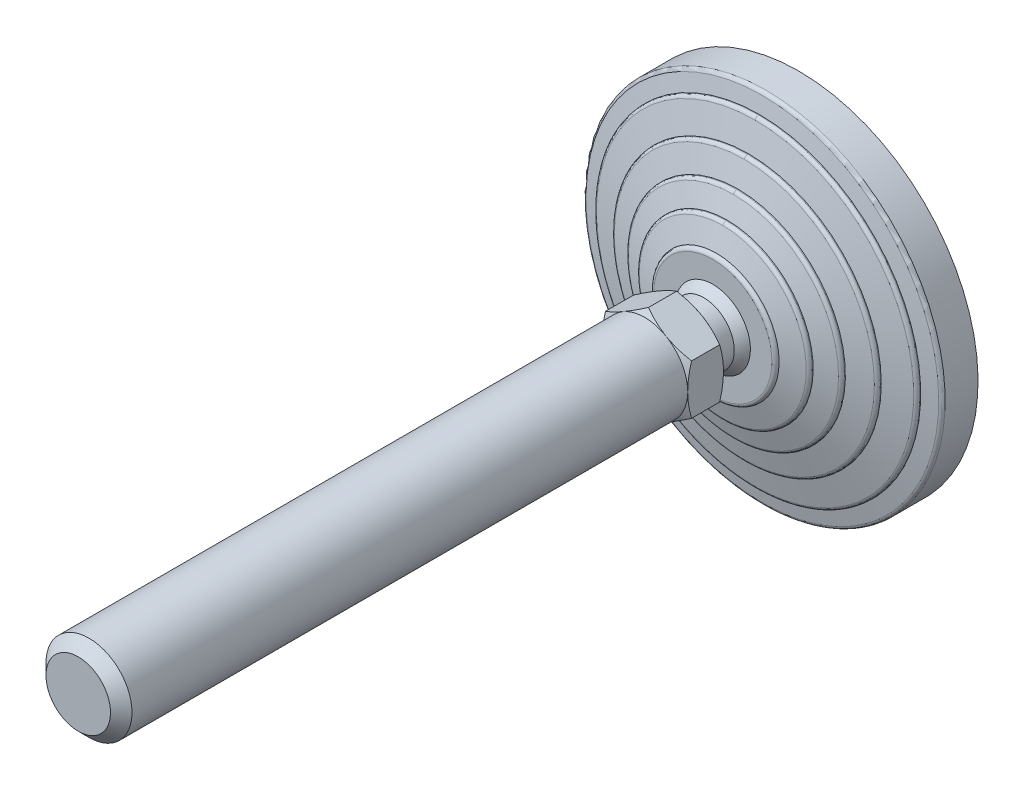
ISO-10303-21;
HEADER;
FILE_DESCRIPTION(('STEP AP214'),'2;1');
FILE_NAME('part.step','',(''),(''),'','','');
FILE_SCHEMA(('AUTOMOTIVE_DESIGN { 1 0 10303 214 1 1 1 1 }'));
ENDSEC;
DATA;
#1=APPLICATION_CONTEXT('core data for automotive mechanical design processes');
#2=APPLICATION_PROTOCOL_DEFINITION('international standard','automotive_design',2000,#1);
#3=PRODUCT_CONTEXT('',#1,'mechanical');
#4=PRODUCT('Part','Part','',(#3));
#5=PRODUCT_RELATED_PRODUCT_CATEGORY('part','',(#4));
#6=PRODUCT_DEFINITION_FORMATION('','',#4);
#7=PRODUCT_DEFINITION_CONTEXT('part definition',#1,'design');
#8=PRODUCT_DEFINITION('design','',#6,#7);
#9=PRODUCT_DEFINITION_SHAPE('','',#8);
#10=(LENGTH_UNIT() NAMED_UNIT(*) SI_UNIT(.MILLI.,.METRE.));
#11=(NAMED_UNIT(*) PLANE_ANGLE_UNIT() SI_UNIT($,.RADIAN.));
#12=(NAMED_UNIT(*) SI_UNIT($,.STERADIAN.) SOLID_ANGLE_UNIT());
#13=UNCERTAINTY_MEASURE_WITH_UNIT(LENGTH_MEASURE(1.E-05),#10,'distance_accuracy_value','');
#14=(GEOMETRIC_REPRESENTATION_CONTEXT(3) GLOBAL_UNCERTAINTY_ASSIGNED_CONTEXT((#13)) GLOBAL_UNIT_ASSIGNED_CONTEXT((#10,
#11,#12)) REPRESENTATION_CONTEXT('',''));
#15=CARTESIAN_POINT('',(0.,0.,0.));
#16=DIRECTION('',(0.,0.,1.));
#17=DIRECTION('',(1.,0.,0.));
#18=AXIS2_PLACEMENT_3D('',#15,#16,#17);
#19=CARTESIAN_POINT('',(-44.173478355,44.022,0.));
#20=DIRECTION('',(0.,0.,1.));
#21=DIRECTION('',(0.,-1.,0.));
#22=AXIS2_PLACEMENT_3D('',#19,#20,#21);
#23=PLANE('',#22);
#24=CARTESIAN_POINT('',(0.,0.,0.));
#25=DIRECTION('',(0.,0.,-1.));
#26=DIRECTION('',(0.,1.,0.));
#27=AXIS2_PLACEMENT_3D('',#24,#25,#26);
#28=CIRCLE('',#27,43.5);
#29=CARTESIAN_POINT('',(0.,43.5,0.));
#30=VERTEX_POINT('',#29);
#31=EDGE_CURVE('E449',#30,#30,#28,.F.);
#32=ORIENTED_EDGE('',*,*,#31,.F.);
#33=EDGE_LOOP('',(#32));
#34=FACE_BOUND('',#33,.T.);
#35=ADVANCED_FACE('F14',(#34),#23,.F.);
#36=CARTESIAN_POINT('',(0.,0.,3.));
#37=DIRECTION('',(0.,0.,-1.));
#38=DIRECTION('',(0.,1.,0.));
#39=AXIS2_PLACEMENT_3D('',#36,#37,#38);
#40=CYLINDRICAL_SURFACE('',#39,43.5);
#41=ORIENTED_EDGE('',*,*,#31,.T.);
#42=EDGE_LOOP('',(#41));
#43=FACE_BOUND('',#42,.T.);
#44=CARTESIAN_POINT('',(0.,0.,3.));
#45=DIRECTION('',(0.,0.,-1.));
#46=DIRECTION('',(0.,1.,0.));
#47=AXIS2_PLACEMENT_3D('',#44,#45,#46);
#48=CIRCLE('',#47,43.5);
#49=CARTESIAN_POINT('',(0.,43.5,3.));
#50=VERTEX_POINT('',#49);
#51=EDGE_CURVE('E452',#50,#50,#48,.T.);
#52=ORIENTED_EDGE('',*,*,#51,.T.);
#53=EDGE_LOOP('',(#52));
#54=FACE_BOUND('',#53,.T.);
#55=ADVANCED_FACE('F296',(#43,#54),#40,.T.);
#56=CARTESIAN_POINT('',(-50.774113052,50.6,3.));
#57=DIRECTION('',(0.,0.,1.));
#58=DIRECTION('',(0.,-1.,0.));
#59=AXIS2_PLACEMENT_3D('',#56,#57,#58);
#60=PLANE('',#59);
#61=ORIENTED_EDGE('',*,*,#51,.F.);
#62=EDGE_LOOP('',(#61));
#63=FACE_BOUND('',#62,.T.);
#64=CARTESIAN_POINT('',(0.,0.,3.));
#65=DIRECTION('',(0.,0.,-1.));
#66=DIRECTION('',(0.,1.,0.));
#67=AXIS2_PLACEMENT_3D('',#64,#65,#66);
#68=CIRCLE('',#67,50.);
#69=CARTESIAN_POINT('',(0.,50.,3.));
#70=VERTEX_POINT('',#69);
#71=EDGE_CURVE('E453',#70,#70,#68,.F.);
#72=ORIENTED_EDGE('',*,*,#71,.F.);
#73=EDGE_LOOP('',(#72));
#74=FACE_BOUND('',#73,.T.);
#75=ADVANCED_FACE('F293',(#63,#74),#60,.F.);
#76=CARTESIAN_POINT('',(0.,0.,12.180196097));
#77=DIRECTION('',(0.,0.,-1.));
#78=DIRECTION('',(0.,1.,0.));
#79=AXIS2_PLACEMENT_3D('',#76,#77,#78);
#80=CYLINDRICAL_SURFACE('',#79,50.);
#81=ORIENTED_EDGE('',*,*,#71,.T.);
#82=EDGE_LOOP('',(#81));
#83=FACE_BOUND('',#82,.T.);
#84=CARTESIAN_POINT('',(0.,0.,12.180196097));
#85=DIRECTION('',(0.,0.,1.));
#86=DIRECTION('',(0.,-1.,0.));
#87=AXIS2_PLACEMENT_3D('',#84,#85,#86);
#88=CIRCLE('',#87,50.);
#89=CARTESIAN_POINT('',(0.,-50.,12.180196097));
#90=VERTEX_POINT('',#89);
#91=EDGE_CURVE('E456',#90,#90,#88,.T.);
#92=ORIENTED_EDGE('',*,*,#91,.F.);
#93=EDGE_LOOP('',(#92));
#94=FACE_BOUND('',#93,.T.);
#95=ADVANCED_FACE('F291',(#83,#94),#80,.T.);
#96=CARTESIAN_POINT('',(0.,0.,12.180196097));
#97=DIRECTION('',(0.,0.,-1.));
#98=DIRECTION('',(0.,1.,0.));
#99=AXIS2_PLACEMENT_3D('',#96,#97,#98);
#100=TOROIDAL_SURFACE('',#99,48.9999999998,1.00000000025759);
#101=ORIENTED_EDGE('',*,*,#91,.T.);
#102=EDGE_LOOP('',(#101));
#103=FACE_BOUND('',#102,.T.);
#104=CARTESIAN_POINT('',(0.,0.,13.160776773));
#105=DIRECTION('',(0.,0.,-1.));
#106=DIRECTION('',(0.,1.,0.));
#107=AXIS2_PLACEMENT_3D('',#104,#105,#106);
#108=CIRCLE('',#107,49.196116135);
#109=CARTESIAN_POINT('',(0.,49.196116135,13.160776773));
#110=VERTEX_POINT('',#109);
#111=EDGE_CURVE('E665',#110,#110,#108,.F.);
#112=ORIENTED_EDGE('',*,*,#111,.F.);
#113=EDGE_LOOP('',(#112));
#114=FACE_BOUND('',#113,.T.);
#115=ADVANCED_FACE('F287',(#103,#114),#100,.T.);
#116=CARTESIAN_POINT('',(0.,0.,14.));
#117=DIRECTION('',(0.,0.,-1.));
#118=DIRECTION('',(1.,0.,0.));
#119=AXIS2_PLACEMENT_3D('',#116,#117,#118);
#120=CONICAL_SURFACE('',#119,45.,1.37340076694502);
#121=ORIENTED_EDGE('',*,*,#111,.T.);
#122=EDGE_LOOP('',(#121));
#123=FACE_BOUND('',#122,.T.);
#124=CARTESIAN_POINT('',(0.,0.,14.));
#125=DIRECTION('',(0.,0.,-1.));
#126=DIRECTION('',(0.,1.,0.));
#127=AXIS2_PLACEMENT_3D('',#124,#125,#126);
#128=CIRCLE('',#127,45.);
#129=CARTESIAN_POINT('',(0.,45.,14.));
#130=VERTEX_POINT('',#129);
#131=EDGE_CURVE('E656',#130,#130,#128,.F.);
#132=ORIENTED_EDGE('',*,*,#131,.F.);
#133=EDGE_LOOP('',(#132));
#134=FACE_BOUND('',#133,.T.);
#135=ADVANCED_FACE('F290',(#123,#134),#120,.T.);
#136=CARTESIAN_POINT('',(0.,0.,14.219223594));
#137=DIRECTION('',(0.,0.,-1.));
#138=DIRECTION('',(1.,0.,0.));
#139=AXIS2_PLACEMENT_3D('',#136,#137,#138);
#140=CYLINDRICAL_SURFACE('',#139,45.);
#141=ORIENTED_EDGE('',*,*,#131,.T.);
#142=EDGE_LOOP('',(#141));
#143=FACE_BOUND('',#142,.T.);
#144=CARTESIAN_POINT('',(0.,0.,14.219223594));
#145=DIRECTION('',(0.,0.,1.));
#146=DIRECTION('',(-1.,0.,0.));
#147=AXIS2_PLACEMENT_3D('',#144,#145,#146);
#148=CIRCLE('',#147,45.);
#149=CARTESIAN_POINT('',(-4.61482714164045E-09,-45.,14.219223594));
#150=VERTEX_POINT('',#149);
#151=CARTESIAN_POINT('',(0.,45.,14.219223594));
#152=VERTEX_POINT('',#151);
#153=EDGE_CURVE('E636',#150,#152,#148,.T.);
#154=ORIENTED_EDGE('',*,*,#153,.F.);
#155=CARTESIAN_POINT('',(0.,0.,14.219223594));
#156=DIRECTION('',(0.,0.,1.));
#157=DIRECTION('',(-1.,0.,0.));
#158=AXIS2_PLACEMENT_3D('',#155,#156,#157);
#159=CIRCLE('',#158,45.);
#160=EDGE_CURVE('E647',#152,#150,#159,.T.);
#161=ORIENTED_EDGE('',*,*,#160,.F.);
#162=EDGE_LOOP('',(#154,#161));
#163=FACE_BOUND('',#162,.T.);
#164=ADVANCED_FACE('F425',(#143,#163),#140,.T.);
#165=CARTESIAN_POINT('',(0.,-45.,14.219223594));
#166=CARTESIAN_POINT('',(-90.0000000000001,-45.,14.219223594));
#167=CARTESIAN_POINT('',(-90.0000000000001,45.,14.219223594));
#168=CARTESIAN_POINT('',(0.,45.,14.219223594));
#169=CARTESIAN_POINT('',(0.,-45.,14.696951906));
#170=CARTESIAN_POINT('',(-90.,-45.,14.696951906));
#171=CARTESIAN_POINT('',(-90.,45.,14.696951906));
#172=CARTESIAN_POINT('',(0.,45.,14.696951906));
#173=CARTESIAN_POINT('',(0.,-44.706000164,15.073499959));
#174=CARTESIAN_POINT('',(-89.4120003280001,-44.706000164,15.073499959));
#175=CARTESIAN_POINT('',(-89.4120003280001,44.706000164,15.073499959));
#176=CARTESIAN_POINT('',(0.,44.706000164,15.073499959));
#177=CARTESIAN_POINT('',(0.,-44.242535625,15.189366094));
#178=CARTESIAN_POINT('',(-88.4850712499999,-44.2425356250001,15.189366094));
#179=CARTESIAN_POINT('',(-88.4850712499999,44.2425356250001,15.189366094));
#180=CARTESIAN_POINT('',(0.,44.242535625,15.189366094));
#181=(BOUNDED_SURFACE() B_SPLINE_SURFACE(3,3,((#165,#166,#167,#168),(#169,#170,#171,#172),(#173,
#174,#175,#176),(#177,#178,#179,#180)),.UNSPECIFIED.,.F.,.F.,
.F.) B_SPLINE_SURFACE_WITH_KNOTS((4,4),(4,4),(0.,1.),(0.,1.),
.UNSPECIFIED.) GEOMETRIC_REPRESENTATION_ITEM() RATIONAL_B_SPLINE_SURFACE(((1.,0.333333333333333,
0.333333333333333,1.),(0.858803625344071,0.28626787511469,0.28626787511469,0.858803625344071),
(0.858803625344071,0.28626787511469,0.28626787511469,0.858803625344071),(1.,0.333333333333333,
0.333333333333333,1.))) REPRESENTATION_ITEM('') SURFACE());
#182=CARTESIAN_POINT('',(0.,45.,14.219223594));
#183=CARTESIAN_POINT('',(0.,45.,14.696951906));
#184=CARTESIAN_POINT('',(0.,44.706000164,15.073499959));
#185=CARTESIAN_POINT('',(0.,44.242535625,15.189366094));
#186=(BOUNDED_CURVE() B_SPLINE_CURVE(3,(#182,#183,#184,#185),.UNSPECIFIED.,.F.,
.F.) B_SPLINE_CURVE_WITH_KNOTS((4,4),(0.,1.),
.UNSPECIFIED.) CURVE() GEOMETRIC_REPRESENTATION_ITEM() RATIONAL_B_SPLINE_CURVE((1.,
0.858803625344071,0.858803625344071,1.)) REPRESENTATION_ITEM(''));
#187=CARTESIAN_POINT('',(0.,44.2425356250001,15.1893660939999));
#188=VERTEX_POINT('',#187);
#189=EDGE_CURVE('E627',#152,#188,#186,.T.);
#190=CARTESIAN_POINT('',(0.,-45.,14.219223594));
#191=CARTESIAN_POINT('',(0.,-45.,14.696951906));
#192=CARTESIAN_POINT('',(0.,-44.706000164,15.073499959));
#193=CARTESIAN_POINT('',(0.,-44.242535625,15.189366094));
#194=(BOUNDED_CURVE() B_SPLINE_CURVE(3,(#190,#191,#192,#193),.UNSPECIFIED.,.F.,
.F.) B_SPLINE_CURVE_WITH_KNOTS((4,4),(0.,1.),
.UNSPECIFIED.) CURVE() GEOMETRIC_REPRESENTATION_ITEM() RATIONAL_B_SPLINE_CURVE((1.,
0.858803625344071,0.858803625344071,1.)) REPRESENTATION_ITEM(''));
#195=CARTESIAN_POINT('',(-1.3611443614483E-08,-44.2425356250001,15.1893660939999));
#196=VERTEX_POINT('',#195);
#197=EDGE_CURVE('E641',#196,#150,#194,.F.);
#198=CARTESIAN_POINT('',(0.,0.,15.1893660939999));
#199=DIRECTION('',(0.,0.,-1.));
#200=DIRECTION('',(0.,1.,0.));
#201=AXIS2_PLACEMENT_3D('',#198,#199,#200);
#202=CIRCLE('',#201,44.242535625);
#203=EDGE_CURVE('E624',#188,#196,#202,.F.);
#204=ORIENTED_EDGE('',*,*,#189,.F.);
#205=ORIENTED_EDGE('',*,*,#160,.T.);
#206=ORIENTED_EDGE('',*,*,#197,.F.);
#207=ORIENTED_EDGE('',*,*,#203,.F.);
#208=EDGE_LOOP('',(#204,#205,#206,#207));
#209=FACE_BOUND('',#208,.T.);
#210=ADVANCED_FACE('F414',(#209),#181,.T.);
#211=CARTESIAN_POINT('',(0.,45.,14.219223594));
#212=CARTESIAN_POINT('',(90.0000000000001,45.,14.219223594));
#213=CARTESIAN_POINT('',(90.0000000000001,-45.,14.219223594));
#214=CARTESIAN_POINT('',(0.,-45.,14.219223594));
#215=CARTESIAN_POINT('',(0.,45.,14.696951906));
#216=CARTESIAN_POINT('',(90.,45.,14.696951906));
#217=CARTESIAN_POINT('',(90.,-45.,14.696951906));
#218=CARTESIAN_POINT('',(0.,-45.,14.696951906));
#219=CARTESIAN_POINT('',(0.,44.706000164,15.073499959));
#220=CARTESIAN_POINT('',(89.4120003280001,44.706000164,15.073499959));
#221=CARTESIAN_POINT('',(89.4120003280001,-44.706000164,15.073499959));
#222=CARTESIAN_POINT('',(0.,-44.706000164,15.073499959));
#223=CARTESIAN_POINT('',(0.,44.242535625,15.189366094));
#224=CARTESIAN_POINT('',(88.4850712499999,44.2425356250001,15.189366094));
#225=CARTESIAN_POINT('',(88.4850712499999,-44.2425356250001,15.189366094));
#226=CARTESIAN_POINT('',(0.,-44.242535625,15.189366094));
#227=(BOUNDED_SURFACE() B_SPLINE_SURFACE(3,3,((#211,#212,#213,#214),(#215,#216,#217,#218),(#219,
#220,#221,#222),(#223,#224,#225,#226)),.UNSPECIFIED.,.F.,.F.,
.F.) B_SPLINE_SURFACE_WITH_KNOTS((4,4),(4,4),(0.,1.),(0.,1.),
.UNSPECIFIED.) GEOMETRIC_REPRESENTATION_ITEM() RATIONAL_B_SPLINE_SURFACE(((1.,0.333333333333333,
0.333333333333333,1.),(0.858803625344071,0.28626787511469,0.28626787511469,0.858803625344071),
(0.858803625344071,0.28626787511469,0.28626787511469,0.858803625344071),(1.,0.333333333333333,
0.333333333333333,1.))) REPRESENTATION_ITEM('') SURFACE());
#228=CARTESIAN_POINT('',(0.,0.,15.1893660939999));
#229=DIRECTION('',(0.,0.,-1.));
#230=DIRECTION('',(0.,1.,0.));
#231=AXIS2_PLACEMENT_3D('',#228,#229,#230);
#232=CIRCLE('',#231,44.242535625);
#233=EDGE_CURVE('E623',#196,#188,#232,.F.);
#234=ORIENTED_EDGE('',*,*,#153,.T.);
#235=ORIENTED_EDGE('',*,*,#189,.T.);
#236=ORIENTED_EDGE('',*,*,#233,.F.);
#237=ORIENTED_EDGE('',*,*,#197,.T.);
#238=EDGE_LOOP('',(#234,#235,#236,#237));
#239=FACE_BOUND('',#238,.T.);
#240=ADVANCED_FACE('F408',(#239),#227,.T.);
#241=CARTESIAN_POINT('',(0.,0.,17.));
#242=DIRECTION('',(0.,0.,-1.));
#243=DIRECTION('',(0.,1.,0.));
#244=AXIS2_PLACEMENT_3D('',#241,#242,#243);
#245=CONICAL_SURFACE('',#244,37.,1.32581766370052);
#246=ORIENTED_EDGE('',*,*,#203,.T.);
#247=ORIENTED_EDGE('',*,*,#233,.T.);
#248=EDGE_LOOP('',(#246,#247));
#249=FACE_BOUND('',#248,.T.);
#250=CARTESIAN_POINT('',(0.,0.,17.));
#251=DIRECTION('',(0.,0.,-1.));
#252=DIRECTION('',(0.,1.,0.));
#253=AXIS2_PLACEMENT_3D('',#250,#251,#252);
#254=CIRCLE('',#253,37.);
#255=CARTESIAN_POINT('',(0.,37.,17.));
#256=VERTEX_POINT('',#255);
#257=EDGE_CURVE('E614',#256,#256,#254,.F.);
#258=ORIENTED_EDGE('',*,*,#257,.F.);
#259=EDGE_LOOP('',(#258));
#260=FACE_BOUND('',#259,.T.);
#261=ADVANCED_FACE('F404',(#249,#260),#245,.T.);
#262=CARTESIAN_POINT('',(0.,0.,17.245698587));
#263=DIRECTION('',(0.,0.,-1.));
#264=DIRECTION('',(1.,0.,0.));
#265=AXIS2_PLACEMENT_3D('',#262,#263,#264);
#266=CYLINDRICAL_SURFACE('',#265,37.);
#267=ORIENTED_EDGE('',*,*,#257,.T.);
#268=EDGE_LOOP('',(#267));
#269=FACE_BOUND('',#268,.T.);
#270=CARTESIAN_POINT('',(0.,0.,17.245698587));
#271=DIRECTION('',(0.,0.,1.));
#272=DIRECTION('',(0.,-1.,0.));
#273=AXIS2_PLACEMENT_3D('',#270,#271,#272);
#274=CIRCLE('',#273,37.);
#275=CARTESIAN_POINT('',(-3.79441342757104E-09,-37.,17.245698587));
#276=VERTEX_POINT('',#275);
#277=CARTESIAN_POINT('',(0.,37.,17.245698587));
#278=VERTEX_POINT('',#277);
#279=EDGE_CURVE('E594',#276,#278,#274,.T.);
#280=ORIENTED_EDGE('',*,*,#279,.F.);
#281=CARTESIAN_POINT('',(0.,0.,17.245698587));
#282=DIRECTION('',(0.,0.,1.));
#283=DIRECTION('',(0.,-1.,0.));
#284=AXIS2_PLACEMENT_3D('',#281,#282,#283);
#285=CIRCLE('',#284,37.);
#286=EDGE_CURVE('E605',#278,#276,#285,.T.);
#287=ORIENTED_EDGE('',*,*,#286,.F.);
#288=EDGE_LOOP('',(#280,#287));
#289=FACE_BOUND('',#288,.T.);
#290=ADVANCED_FACE('F395',(#269,#289),#266,.T.);
#291=CARTESIAN_POINT('',(0.,-37.,17.245698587));
#292=CARTESIAN_POINT('',(-74.,-37.,17.245698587));
#293=CARTESIAN_POINT('',(-74.,37.,17.245698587));
#294=CARTESIAN_POINT('',(0.,37.,17.245698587));
#295=CARTESIAN_POINT('',(0.,-37.,17.709515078));
#296=CARTESIAN_POINT('',(-74.0000000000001,-37.,17.709515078));
#297=CARTESIAN_POINT('',(-74.0000000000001,37.,17.709515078));
#298=CARTESIAN_POINT('',(0.,37.,17.709515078));
#299=CARTESIAN_POINT('',(0.,-36.720691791,18.079802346));
#300=CARTESIAN_POINT('',(-73.441383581,-36.720691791,18.079802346));
#301=CARTESIAN_POINT('',(-73.441383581,36.720691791,18.079802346));
#302=CARTESIAN_POINT('',(0.,36.720691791,18.079802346));
#303=CARTESIAN_POINT('',(0.,-36.274721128,18.207222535));
#304=CARTESIAN_POINT('',(-72.549442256,-36.274721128,18.207222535));
#305=CARTESIAN_POINT('',(-72.549442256,36.274721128,18.207222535));
#306=CARTESIAN_POINT('',(0.,36.274721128,18.207222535));
#307=(BOUNDED_SURFACE() B_SPLINE_SURFACE(3,3,((#291,#292,#293,#294),(#295,#296,#297,#298),(#299,
#300,#301,#302),(#303,#304,#305,#306)),.UNSPECIFIED.,.F.,.F.,
.F.) B_SPLINE_SURFACE_WITH_KNOTS((4,4),(4,4),(0.,1.),(0.,1.),
.UNSPECIFIED.) GEOMETRIC_REPRESENTATION_ITEM() RATIONAL_B_SPLINE_SURFACE(((1.,0.333333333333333,
0.333333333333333,1.),(0.865565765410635,0.288521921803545,0.288521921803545,0.865565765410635),
(0.865565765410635,0.288521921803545,0.288521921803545,0.865565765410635),(1.,0.333333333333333,
0.333333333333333,1.))) REPRESENTATION_ITEM('') SURFACE());
#308=CARTESIAN_POINT('',(0.,37.,17.245698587));
#309=CARTESIAN_POINT('',(0.,37.,17.709515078));
#310=CARTESIAN_POINT('',(0.,36.720691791,18.079802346));
#311=CARTESIAN_POINT('',(0.,36.274721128,18.207222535));
#312=(BOUNDED_CURVE() B_SPLINE_CURVE(3,(#308,#309,#310,#311),.UNSPECIFIED.,.F.,
.F.) B_SPLINE_CURVE_WITH_KNOTS((4,4),(0.,1.),
.UNSPECIFIED.) CURVE() GEOMETRIC_REPRESENTATION_ITEM() RATIONAL_B_SPLINE_CURVE((1.,
0.865565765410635,0.865565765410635,1.)) REPRESENTATION_ITEM(''));
#313=CARTESIAN_POINT('',(0.,36.2747211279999,18.207222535));
#314=VERTEX_POINT('',#313);
#315=EDGE_CURVE('E585',#278,#314,#312,.T.);
#316=CARTESIAN_POINT('',(0.,-37.,17.245698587));
#317=CARTESIAN_POINT('',(0.,-37.,17.709515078));
#318=CARTESIAN_POINT('',(0.,-36.720691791,18.079802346));
#319=CARTESIAN_POINT('',(0.,-36.274721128,18.207222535));
#320=(BOUNDED_CURVE() B_SPLINE_CURVE(3,(#316,#317,#318,#319),.UNSPECIFIED.,.F.,
.F.) B_SPLINE_CURVE_WITH_KNOTS((4,4),(0.,1.),
.UNSPECIFIED.) CURVE() GEOMETRIC_REPRESENTATION_ITEM() RATIONAL_B_SPLINE_CURVE((1.,
0.865565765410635,0.865565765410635,1.)) REPRESENTATION_ITEM(''));
#321=CARTESIAN_POINT('',(-1.11601045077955E-08,-36.2747211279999,18.207222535));
#322=VERTEX_POINT('',#321);
#323=EDGE_CURVE('E599',#322,#276,#320,.F.);
#324=CARTESIAN_POINT('',(0.,0.,18.207222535));
#325=DIRECTION('',(0.,0.,-1.));
#326=DIRECTION('',(0.,1.,0.));
#327=AXIS2_PLACEMENT_3D('',#324,#325,#326);
#328=CIRCLE('',#327,36.274721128);
#329=EDGE_CURVE('E582',#314,#322,#328,.F.);
#330=ORIENTED_EDGE('',*,*,#315,.F.);
#331=ORIENTED_EDGE('',*,*,#286,.T.);
#332=ORIENTED_EDGE('',*,*,#323,.F.);
#333=ORIENTED_EDGE('',*,*,#329,.F.);
#334=EDGE_LOOP('',(#330,#331,#332,#333));
#335=FACE_BOUND('',#334,.T.);
#336=ADVANCED_FACE('F384',(#335),#307,.T.);
#337=CARTESIAN_POINT('',(0.,37.,17.245698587));
#338=CARTESIAN_POINT('',(74.,37.,17.245698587));
#339=CARTESIAN_POINT('',(74.,-37.,17.245698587));
#340=CARTESIAN_POINT('',(0.,-37.,17.245698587));
#341=CARTESIAN_POINT('',(0.,37.,17.709515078));
#342=CARTESIAN_POINT('',(74.0000000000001,37.,17.709515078));
#343=CARTESIAN_POINT('',(74.0000000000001,-37.,17.709515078));
#344=CARTESIAN_POINT('',(0.,-37.,17.709515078));
#345=CARTESIAN_POINT('',(0.,36.720691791,18.079802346));
#346=CARTESIAN_POINT('',(73.441383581,36.720691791,18.079802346));
#347=CARTESIAN_POINT('',(73.441383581,-36.720691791,18.079802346));
#348=CARTESIAN_POINT('',(0.,-36.720691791,18.079802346));
#349=CARTESIAN_POINT('',(0.,36.274721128,18.207222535));
#350=CARTESIAN_POINT('',(72.549442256,36.274721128,18.207222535));
#351=CARTESIAN_POINT('',(72.549442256,-36.274721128,18.207222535));
#352=CARTESIAN_POINT('',(0.,-36.274721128,18.207222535));
#353=(BOUNDED_SURFACE() B_SPLINE_SURFACE(3,3,((#337,#338,#339,#340),(#341,#342,#343,#344),(#345,
#346,#347,#348),(#349,#350,#351,#352)),.UNSPECIFIED.,.F.,.F.,
.F.) B_SPLINE_SURFACE_WITH_KNOTS((4,4),(4,4),(0.,1.),(0.,1.),
.UNSPECIFIED.) GEOMETRIC_REPRESENTATION_ITEM() RATIONAL_B_SPLINE_SURFACE(((1.,0.333333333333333,
0.333333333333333,1.),(0.865565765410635,0.288521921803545,0.288521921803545,0.865565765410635),
(0.865565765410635,0.288521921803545,0.288521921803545,0.865565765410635),(1.,0.333333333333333,
0.333333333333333,1.))) REPRESENTATION_ITEM('') SURFACE());
#354=CARTESIAN_POINT('',(0.,0.,18.207222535));
#355=DIRECTION('',(0.,0.,-1.));
#356=DIRECTION('',(0.,1.,0.));
#357=AXIS2_PLACEMENT_3D('',#354,#355,#356);
#358=CIRCLE('',#357,36.274721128);
#359=EDGE_CURVE('E581',#322,#314,#358,.F.);
#360=ORIENTED_EDGE('',*,*,#279,.T.);
#361=ORIENTED_EDGE('',*,*,#315,.T.);
#362=ORIENTED_EDGE('',*,*,#359,.F.);
#363=ORIENTED_EDGE('',*,*,#323,.T.);
#364=EDGE_LOOP('',(#360,#361,#362,#363));
#365=FACE_BOUND('',#364,.T.);
#366=ADVANCED_FACE('F378',(#365),#353,.T.);
#367=CARTESIAN_POINT('',(0.,0.,20.));
#368=DIRECTION('',(0.,0.,-1.));
#369=DIRECTION('',(1.,0.,0.));
#370=AXIS2_PLACEMENT_3D('',#367,#368,#369);
#371=CONICAL_SURFACE('',#370,30.,1.29249666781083);
#372=ORIENTED_EDGE('',*,*,#329,.T.);
#373=ORIENTED_EDGE('',*,*,#359,.T.);
#374=EDGE_LOOP('',(#372,#373));
#375=FACE_BOUND('',#374,.T.);
#376=CARTESIAN_POINT('',(0.,0.,20.));
#377=DIRECTION('',(0.,0.,-1.));
#378=DIRECTION('',(0.,1.,0.));
#379=AXIS2_PLACEMENT_3D('',#376,#377,#378);
#380=CIRCLE('',#379,30.);
#381=CARTESIAN_POINT('',(0.,30.,20.));
#382=VERTEX_POINT('',#381);
#383=EDGE_CURVE('E572',#382,#382,#380,.F.);
#384=ORIENTED_EDGE('',*,*,#383,.F.);
#385=EDGE_LOOP('',(#384));
#386=FACE_BOUND('',#385,.T.);
#387=ADVANCED_FACE('F374',(#375,#386),#371,.T.);
#388=CARTESIAN_POINT('',(0.,0.,20.27924078));
#389=DIRECTION('',(0.,0.,-1.));
#390=DIRECTION('',(0.,1.,0.));
#391=AXIS2_PLACEMENT_3D('',#388,#389,#390);
#392=CYLINDRICAL_SURFACE('',#391,30.);
#393=ORIENTED_EDGE('',*,*,#383,.T.);
#394=EDGE_LOOP('',(#393));
#395=FACE_BOUND('',#394,.T.);
#396=CARTESIAN_POINT('',(0.,0.,20.27924078));
#397=DIRECTION('',(0.,0.,1.));
#398=DIRECTION('',(0.,-1.,0.));
#399=AXIS2_PLACEMENT_3D('',#396,#397,#398);
#400=CIRCLE('',#399,30.);
#401=CARTESIAN_POINT('',(-3.0765514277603E-09,-30.,20.27924078));
#402=VERTEX_POINT('',#401);
#403=CARTESIAN_POINT('',(0.,30.,20.27924078));
#404=VERTEX_POINT('',#403);
#405=EDGE_CURVE('E552',#402,#404,#400,.T.);
#406=ORIENTED_EDGE('',*,*,#405,.F.);
#407=CARTESIAN_POINT('',(0.,0.,20.27924078));
#408=DIRECTION('',(0.,0.,1.));
#409=DIRECTION('',(0.,-1.,0.));
#410=AXIS2_PLACEMENT_3D('',#407,#408,#409);
#411=CIRCLE('',#410,30.);
#412=EDGE_CURVE('E563',#404,#402,#411,.T.);
#413=ORIENTED_EDGE('',*,*,#412,.F.);
#414=EDGE_LOOP('',(#406,#413));
#415=FACE_BOUND('',#414,.T.);
#416=ADVANCED_FACE('F365',(#395,#415),#392,.T.);
#417=CARTESIAN_POINT('',(0.,-30.,20.27924078));
#418=CARTESIAN_POINT('',(-60.0000000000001,-30.,20.27924078));
#419=CARTESIAN_POINT('',(-60.0000000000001,30.,20.27924078));
#420=CARTESIAN_POINT('',(0.,30.,20.27924078));
#421=CARTESIAN_POINT('',(0.,-30.,20.725161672));
#422=CARTESIAN_POINT('',(-60.,-30.,20.725161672));
#423=CARTESIAN_POINT('',(-60.,30.,20.725161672));
#424=CARTESIAN_POINT('',(0.,30.,20.725161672));
#425=CARTESIAN_POINT('',(0.,-29.739265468,21.086911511));
#426=CARTESIAN_POINT('',(-59.478530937,-29.739265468,21.086911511));
#427=CARTESIAN_POINT('',(-59.478530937,29.739265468,21.086911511));
#428=CARTESIAN_POINT('',(0.,29.739265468,21.086911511));
#429=CARTESIAN_POINT('',(0.,-29.316227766,21.227924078));
#430=CARTESIAN_POINT('',(-58.6324555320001,-29.316227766,21.227924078));
#431=CARTESIAN_POINT('',(-58.6324555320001,29.316227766,21.227924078));
#432=CARTESIAN_POINT('',(0.,29.316227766,21.227924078));
#433=(BOUNDED_SURFACE() B_SPLINE_SURFACE(3,3,((#417,#418,#419,#420),(#421,#422,#423,#424),(#425,
#426,#427,#428),(#429,#430,#431,#432)),.UNSPECIFIED.,.F.,.F.,
.F.) B_SPLINE_SURFACE_WITH_KNOTS((4,4),(4,4),(0.,1.),(0.,1.),
.UNSPECIFIED.) GEOMETRIC_REPRESENTATION_ITEM() RATIONAL_B_SPLINE_SURFACE(((1.,0.333333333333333,
0.333333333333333,1.),(0.874161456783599,0.2913871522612,0.2913871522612,0.874161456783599),
(0.874161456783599,0.2913871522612,0.2913871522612,0.874161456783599),(1.,0.333333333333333,
0.333333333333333,1.))) REPRESENTATION_ITEM('') SURFACE());
#434=CARTESIAN_POINT('',(0.,30.,20.27924078));
#435=CARTESIAN_POINT('',(0.,30.,20.725161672));
#436=CARTESIAN_POINT('',(0.,29.739265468,21.086911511));
#437=CARTESIAN_POINT('',(0.,29.316227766,21.227924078));
#438=(BOUNDED_CURVE() B_SPLINE_CURVE(3,(#434,#435,#436,#437),.UNSPECIFIED.,.F.,
.F.) B_SPLINE_CURVE_WITH_KNOTS((4,4),(0.,1.),
.UNSPECIFIED.) CURVE() GEOMETRIC_REPRESENTATION_ITEM() RATIONAL_B_SPLINE_CURVE((1.,
0.874161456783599,0.874161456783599,1.)) REPRESENTATION_ITEM(''));
#439=CARTESIAN_POINT('',(0.,29.316227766,21.227924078));
#440=VERTEX_POINT('',#439);
#441=EDGE_CURVE('E543',#404,#440,#438,.T.);
#442=CARTESIAN_POINT('',(0.,-30.,20.27924078));
#443=CARTESIAN_POINT('',(0.,-30.,20.725161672));
#444=CARTESIAN_POINT('',(0.,-29.739265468,21.086911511));
#445=CARTESIAN_POINT('',(0.,-29.316227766,21.227924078));
#446=(BOUNDED_CURVE() B_SPLINE_CURVE(3,(#442,#443,#444,#445),.UNSPECIFIED.,.F.,
.F.) B_SPLINE_CURVE_WITH_KNOTS((4,4),(0.,1.),
.UNSPECIFIED.) CURVE() GEOMETRIC_REPRESENTATION_ITEM() RATIONAL_B_SPLINE_CURVE((1.,
0.874161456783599,0.874161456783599,1.)) REPRESENTATION_ITEM(''));
#447=CARTESIAN_POINT('',(-9.01928823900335E-09,-29.316227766,21.227924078));
#448=VERTEX_POINT('',#447);
#449=EDGE_CURVE('E557',#448,#402,#446,.F.);
#450=CARTESIAN_POINT('',(0.,0.,21.227924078));
#451=DIRECTION('',(0.,0.,-1.));
#452=DIRECTION('',(0.,1.,0.));
#453=AXIS2_PLACEMENT_3D('',#450,#451,#452);
#454=CIRCLE('',#453,29.316227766);
#455=EDGE_CURVE('E540',#440,#448,#454,.F.);
#456=ORIENTED_EDGE('',*,*,#441,.F.);
#457=ORIENTED_EDGE('',*,*,#412,.T.);
#458=ORIENTED_EDGE('',*,*,#449,.F.);
#459=ORIENTED_EDGE('',*,*,#455,.F.);
#460=EDGE_LOOP('',(#456,#457,#458,#459));
#461=FACE_BOUND('',#460,.T.);
#462=ADVANCED_FACE('F354',(#461),#433,.T.);
#463=CARTESIAN_POINT('',(0.,30.,20.27924078));
#464=CARTESIAN_POINT('',(60.0000000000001,30.,20.27924078));
#465=CARTESIAN_POINT('',(60.0000000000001,-30.,20.27924078));
#466=CARTESIAN_POINT('',(0.,-30.,20.27924078));
#467=CARTESIAN_POINT('',(0.,30.,20.725161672));
#468=CARTESIAN_POINT('',(60.,30.,20.725161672));
#469=CARTESIAN_POINT('',(60.,-30.,20.725161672));
#470=CARTESIAN_POINT('',(0.,-30.,20.725161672));
#471=CARTESIAN_POINT('',(0.,29.739265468,21.086911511));
#472=CARTESIAN_POINT('',(59.478530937,29.739265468,21.086911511));
#473=CARTESIAN_POINT('',(59.478530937,-29.739265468,21.086911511));
#474=CARTESIAN_POINT('',(0.,-29.739265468,21.086911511));
#475=CARTESIAN_POINT('',(0.,29.316227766,21.227924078));
#476=CARTESIAN_POINT('',(58.6324555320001,29.316227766,21.227924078));
#477=CARTESIAN_POINT('',(58.6324555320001,-29.316227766,21.227924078));
#478=CARTESIAN_POINT('',(0.,-29.316227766,21.227924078));
#479=(BOUNDED_SURFACE() B_SPLINE_SURFACE(3,3,((#463,#464,#465,#466),(#467,#468,#469,#470),(#471,
#472,#473,#474),(#475,#476,#477,#478)),.UNSPECIFIED.,.F.,.F.,
.F.) B_SPLINE_SURFACE_WITH_KNOTS((4,4),(4,4),(0.,1.),(0.,1.),
.UNSPECIFIED.) GEOMETRIC_REPRESENTATION_ITEM() RATIONAL_B_SPLINE_SURFACE(((1.,0.333333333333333,
0.333333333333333,1.),(0.874161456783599,0.2913871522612,0.2913871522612,0.874161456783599),
(0.874161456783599,0.2913871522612,0.2913871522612,0.874161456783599),(1.,0.333333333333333,
0.333333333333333,1.))) REPRESENTATION_ITEM('') SURFACE());
#480=CARTESIAN_POINT('',(0.,0.,21.227924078));
#481=DIRECTION('',(0.,0.,-1.));
#482=DIRECTION('',(0.,1.,0.));
#483=AXIS2_PLACEMENT_3D('',#480,#481,#482);
#484=CIRCLE('',#483,29.316227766);
#485=EDGE_CURVE('E539',#448,#440,#484,.F.);
#486=ORIENTED_EDGE('',*,*,#405,.T.);
#487=ORIENTED_EDGE('',*,*,#441,.T.);
#488=ORIENTED_EDGE('',*,*,#485,.F.);
#489=ORIENTED_EDGE('',*,*,#449,.T.);
#490=EDGE_LOOP('',(#486,#487,#488,#489));
#491=FACE_BOUND('',#490,.T.);
#492=ADVANCED_FACE('F348',(#491),#479,.T.);
#493=CARTESIAN_POINT('',(0.,0.,23.));
#494=DIRECTION('',(0.,0.,-1.));
#495=DIRECTION('',(0.,1.,0.));
#496=AXIS2_PLACEMENT_3D('',#493,#494,#495);
#497=CONICAL_SURFACE('',#496,24.,1.24904577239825);
#498=ORIENTED_EDGE('',*,*,#455,.T.);
#499=ORIENTED_EDGE('',*,*,#485,.T.);
#500=EDGE_LOOP('',(#498,#499));
#501=FACE_BOUND('',#500,.T.);
#502=CARTESIAN_POINT('',(0.,0.,23.));
#503=DIRECTION('',(0.,0.,-1.));
#504=DIRECTION('',(0.,1.,0.));
#505=AXIS2_PLACEMENT_3D('',#502,#503,#504);
#506=CIRCLE('',#505,24.);
#507=CARTESIAN_POINT('',(0.,24.,23.));
#508=VERTEX_POINT('',#507);
#509=EDGE_CURVE('E530',#508,#508,#506,.F.);
#510=ORIENTED_EDGE('',*,*,#509,.F.);
#511=EDGE_LOOP('',(#510));
#512=FACE_BOUND('',#511,.T.);
#513=ADVANCED_FACE('F344',(#501,#512),#497,.T.);
#514=CARTESIAN_POINT('',(0.,0.,23.261425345));
#515=DIRECTION('',(0.,0.,-1.));
#516=DIRECTION('',(0.,1.,0.));
#517=AXIS2_PLACEMENT_3D('',#514,#515,#516);
#518=CYLINDRICAL_SURFACE('',#517,24.);
#519=ORIENTED_EDGE('',*,*,#509,.T.);
#520=EDGE_LOOP('',(#519));
#521=FACE_BOUND('',#520,.T.);
#522=CARTESIAN_POINT('',(0.,0.,23.261425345));
#523=DIRECTION('',(0.,0.,1.));
#524=DIRECTION('',(0.,-1.,0.));
#525=AXIS2_PLACEMENT_3D('',#522,#523,#524);
#526=CIRCLE('',#525,24.);
#527=CARTESIAN_POINT('',(-2.46124114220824E-09,-24.,23.261425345));
#528=VERTEX_POINT('',#527);
#529=CARTESIAN_POINT('',(0.,24.,23.261425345));
#530=VERTEX_POINT('',#529);
#531=EDGE_CURVE('E510',#528,#530,#526,.T.);
#532=ORIENTED_EDGE('',*,*,#531,.F.);
#533=CARTESIAN_POINT('',(0.,0.,23.261425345));
#534=DIRECTION('',(0.,0.,1.));
#535=DIRECTION('',(0.,-1.,0.));
#536=AXIS2_PLACEMENT_3D('',#533,#534,#535);
#537=CIRCLE('',#536,24.);
#538=EDGE_CURVE('E521',#530,#528,#537,.T.);
#539=ORIENTED_EDGE('',*,*,#538,.F.);
#540=EDGE_LOOP('',(#532,#539));
#541=FACE_BOUND('',#540,.T.);
#542=ADVANCED_FACE('F335',(#521,#541),#518,.T.);
#543=CARTESIAN_POINT('',(0.,-24.,23.261425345));
#544=CARTESIAN_POINT('',(-48.,-24.,23.261425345));
#545=CARTESIAN_POINT('',(-48.,24.,23.261425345));
#546=CARTESIAN_POINT('',(0.,24.,23.261425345));
#547=CARTESIAN_POINT('',(0.,-24.,23.716888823));
#548=CARTESIAN_POINT('',(-48.,-24.,23.716888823));
#549=CARTESIAN_POINT('',(-48.,24.,23.716888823));
#550=CARTESIAN_POINT('',(0.,24.,23.716888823));
#551=CARTESIAN_POINT('',(0.,-23.72940828,24.083258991));
#552=CARTESIAN_POINT('',(-47.458816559,-23.72940828,24.083258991));
#553=CARTESIAN_POINT('',(-47.458816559,23.72940828,24.083258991));
#554=CARTESIAN_POINT('',(0.,23.72940828,24.083258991));
#555=CARTESIAN_POINT('',(0.,-23.294085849,24.217204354));
#556=CARTESIAN_POINT('',(-46.5881716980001,-23.294085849,24.217204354));
#557=CARTESIAN_POINT('',(-46.5881716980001,23.294085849,24.217204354));
#558=CARTESIAN_POINT('',(0.,23.294085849,24.217204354));
#559=(BOUNDED_SURFACE() B_SPLINE_SURFACE(3,3,((#543,#544,#545,#546),(#547,#548,#549,#550),(#551,
#552,#553,#554),(#555,#556,#557,#558)),.UNSPECIFIED.,.F.,.F.,
.F.) B_SPLINE_SURFACE_WITH_KNOTS((4,4),(4,4),(0.,1.),(0.,1.),
.UNSPECIFIED.) GEOMETRIC_REPRESENTATION_ITEM() RATIONAL_B_SPLINE_SURFACE(((1.,0.333333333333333,
0.333333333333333,1.),(0.869593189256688,0.289864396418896,0.289864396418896,0.869593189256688),
(0.869593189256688,0.289864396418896,0.289864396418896,0.869593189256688),(1.,0.333333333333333,
0.333333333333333,1.))) REPRESENTATION_ITEM('') SURFACE());
#560=CARTESIAN_POINT('',(0.,24.,23.261425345));
#561=CARTESIAN_POINT('',(0.,24.,23.716888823));
#562=CARTESIAN_POINT('',(0.,23.72940828,24.083258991));
#563=CARTESIAN_POINT('',(0.,23.294085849,24.217204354));
#564=(BOUNDED_CURVE() B_SPLINE_CURVE(3,(#560,#561,#562,#563),.UNSPECIFIED.,.F.,
.F.) B_SPLINE_CURVE_WITH_KNOTS((4,4),(0.,1.),
.UNSPECIFIED.) CURVE() GEOMETRIC_REPRESENTATION_ITEM() RATIONAL_B_SPLINE_CURVE((1.,
0.869593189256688,0.869593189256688,1.)) REPRESENTATION_ITEM(''));
#565=CARTESIAN_POINT('',(0.,23.2940858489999,24.2172043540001));
#566=VERTEX_POINT('',#565);
#567=EDGE_CURVE('E501',#530,#566,#564,.T.);
#568=CARTESIAN_POINT('',(0.,-24.,23.261425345));
#569=CARTESIAN_POINT('',(0.,-24.,23.716888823));
#570=CARTESIAN_POINT('',(0.,-23.72940828,24.083258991));
#571=CARTESIAN_POINT('',(0.,-23.294085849,24.217204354));
#572=(BOUNDED_CURVE() B_SPLINE_CURVE(3,(#568,#569,#570,#571),.UNSPECIFIED.,.F.,
.F.) B_SPLINE_CURVE_WITH_KNOTS((4,4),(0.,1.),
.UNSPECIFIED.) CURVE() GEOMETRIC_REPRESENTATION_ITEM() RATIONAL_B_SPLINE_CURVE((1.,
0.869593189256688,0.869593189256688,1.)) REPRESENTATION_ITEM(''));
#573=CARTESIAN_POINT('',(-7.16654530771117E-09,-23.2940858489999,24.2172043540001));
#574=VERTEX_POINT('',#573);
#575=EDGE_CURVE('E515',#574,#528,#572,.F.);
#576=CARTESIAN_POINT('',(0.,0.,24.2172043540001));
#577=DIRECTION('',(0.,0.,-1.));
#578=DIRECTION('',(0.,1.,0.));
#579=AXIS2_PLACEMENT_3D('',#576,#577,#578);
#580=CIRCLE('',#579,23.294085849);
#581=EDGE_CURVE('E498',#566,#574,#580,.F.);
#582=ORIENTED_EDGE('',*,*,#567,.F.);
#583=ORIENTED_EDGE('',*,*,#538,.T.);
#584=ORIENTED_EDGE('',*,*,#575,.F.);
#585=ORIENTED_EDGE('',*,*,#581,.F.);
#586=EDGE_LOOP('',(#582,#583,#584,#585));
#587=FACE_BOUND('',#586,.T.);
#588=ADVANCED_FACE('F324',(#587),#559,.T.);
#589=CARTESIAN_POINT('',(0.,24.,23.261425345));
#590=CARTESIAN_POINT('',(48.,24.,23.261425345));
#591=CARTESIAN_POINT('',(48.,-24.,23.261425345));
#592=CARTESIAN_POINT('',(0.,-24.,23.261425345));
#593=CARTESIAN_POINT('',(0.,24.,23.716888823));
#594=CARTESIAN_POINT('',(48.,24.,23.716888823));
#595=CARTESIAN_POINT('',(48.,-24.,23.716888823));
#596=CARTESIAN_POINT('',(0.,-24.,23.716888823));
#597=CARTESIAN_POINT('',(0.,23.72940828,24.083258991));
#598=CARTESIAN_POINT('',(47.458816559,23.72940828,24.083258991));
#599=CARTESIAN_POINT('',(47.458816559,-23.72940828,24.083258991));
#600=CARTESIAN_POINT('',(0.,-23.72940828,24.083258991));
#601=CARTESIAN_POINT('',(0.,23.294085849,24.217204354));
#602=CARTESIAN_POINT('',(46.5881716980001,23.294085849,24.217204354));
#603=CARTESIAN_POINT('',(46.5881716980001,-23.294085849,24.217204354));
#604=CARTESIAN_POINT('',(0.,-23.294085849,24.217204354));
#605=(BOUNDED_SURFACE() B_SPLINE_SURFACE(3,3,((#589,#590,#591,#592),(#593,#594,#595,#596),(#597,
#598,#599,#600),(#601,#602,#603,#604)),.UNSPECIFIED.,.F.,.F.,
.F.) B_SPLINE_SURFACE_WITH_KNOTS((4,4),(4,4),(0.,1.),(0.,1.),
.UNSPECIFIED.) GEOMETRIC_REPRESENTATION_ITEM() RATIONAL_B_SPLINE_SURFACE(((1.,0.333333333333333,
0.333333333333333,1.),(0.869593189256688,0.289864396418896,0.289864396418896,0.869593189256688),
(0.869593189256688,0.289864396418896,0.289864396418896,0.869593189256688),(1.,0.333333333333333,
0.333333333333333,1.))) REPRESENTATION_ITEM('') SURFACE());
#606=CARTESIAN_POINT('',(0.,0.,24.2172043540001));
#607=DIRECTION('',(0.,0.,-1.));
#608=DIRECTION('',(0.,1.,0.));
#609=AXIS2_PLACEMENT_3D('',#606,#607,#608);
#610=CIRCLE('',#609,23.294085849);
#611=EDGE_CURVE('E497',#574,#566,#610,.F.);
#612=ORIENTED_EDGE('',*,*,#531,.T.);
#613=ORIENTED_EDGE('',*,*,#567,.T.);
#614=ORIENTED_EDGE('',*,*,#611,.F.);
#615=ORIENTED_EDGE('',*,*,#575,.T.);
#616=EDGE_LOOP('',(#612,#613,#614,#615));
#617=FACE_BOUND('',#616,.T.);
#618=ADVANCED_FACE('F318',(#617),#605,.T.);
#619=CARTESIAN_POINT('',(0.,0.,26.));
#620=DIRECTION('',(0.,0.,-1.));
#621=DIRECTION('',(1.,0.,0.));
#622=AXIS2_PLACEMENT_3D('',#619,#620,#621);
#623=CONICAL_SURFACE('',#622,17.5,1.27229739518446);
#624=ORIENTED_EDGE('',*,*,#581,.T.);
#625=ORIENTED_EDGE('',*,*,#611,.T.);
#626=EDGE_LOOP('',(#624,#625));
#627=FACE_BOUND('',#626,.T.);
#628=CARTESIAN_POINT('',(0.,0.,26.));
#629=DIRECTION('',(0.,0.,1.));
#630=DIRECTION('',(0.,-1.,0.));
#631=AXIS2_PLACEMENT_3D('',#628,#629,#630);
#632=CIRCLE('',#631,17.5);
#633=CARTESIAN_POINT('',(0.,-17.5,26.));
#634=VERTEX_POINT('',#633);
#635=EDGE_CURVE('E493',#634,#634,#632,.T.);
#636=ORIENTED_EDGE('',*,*,#635,.F.);
#637=EDGE_LOOP('',(#636));
#638=FACE_BOUND('',#637,.T.);
#639=ADVANCED_FACE('F285',(#627,#638),#623,.T.);
#640=CARTESIAN_POINT('',(0.,0.,26.));
#641=DIRECTION('',(0.,0.,-1.));
#642=DIRECTION('',(0.,1.,0.));
#643=AXIS2_PLACEMENT_3D('',#640,#641,#642);
#644=TOROIDAL_SURFACE('',#643,16.5,1.);
#645=ORIENTED_EDGE('',*,*,#635,.T.);
#646=EDGE_LOOP('',(#645));
#647=FACE_BOUND('',#646,.T.);
#648=CARTESIAN_POINT('',(0.,0.,27.));
#649=DIRECTION('',(0.,0.,-1.));
#650=DIRECTION('',(0.,1.,0.));
#651=AXIS2_PLACEMENT_3D('',#648,#649,#650);
#652=CIRCLE('',#651,16.499999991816);
#653=CARTESIAN_POINT('',(0.,16.499999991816,27.));
#654=VERTEX_POINT('',#653);
#655=EDGE_CURVE('E496',#654,#654,#652,.T.);
#656=ORIENTED_EDGE('',*,*,#655,.T.);
#657=EDGE_LOOP('',(#656));
#658=FACE_BOUND('',#657,.T.);
#659=ADVANCED_FACE('F281',(#647,#658),#644,.T.);
#660=CARTESIAN_POINT('',(-16.755457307,-16.698,27.));
#661=DIRECTION('',(0.,0.,-1.));
#662=DIRECTION('',(0.,1.,0.));
#663=AXIS2_PLACEMENT_3D('',#660,#661,#662);
#664=PLANE('',#663);
#665=CARTESIAN_POINT('',(0.,0.,27.));
#666=DIRECTION('',(0.,0.,-1.));
#667=DIRECTION('',(0.,1.,0.));
#668=AXIS2_PLACEMENT_3D('',#665,#666,#667);
#669=CIRCLE('',#668,10.4931261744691);
#670=CARTESIAN_POINT('',(0.,10.4931261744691,27.));
#671=VERTEX_POINT('',#670);
#672=EDGE_CURVE('E492',#671,#671,#669,.F.);
#673=ORIENTED_EDGE('',*,*,#672,.F.);
#674=EDGE_LOOP('',(#673));
#675=FACE_BOUND('',#674,.T.);
#676=ORIENTED_EDGE('',*,*,#655,.F.);
#677=EDGE_LOOP('',(#676));
#678=FACE_BOUND('',#677,.T.);
#679=ADVANCED_FACE('F277',(#675,#678),#664,.F.);
#680=CARTESIAN_POINT('',(0.,0.,20.678860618));
#681=DIRECTION('',(0.,0.,-1.));
#682=DIRECTION('',(1.,0.,0.));
#683=AXIS2_PLACEMENT_3D('',#680,#681,#682);
#684=SPHERICAL_SURFACE('',#683,12.25);
#685=ORIENTED_EDGE('',*,*,#672,.T.);
#686=EDGE_LOOP('',(#685));
#687=FACE_BOUND('',#686,.T.);
#688=CARTESIAN_POINT('',(0.,0.,29.5));
#689=DIRECTION('',(0.,0.,-1.));
#690=DIRECTION('',(0.,1.,0.));
#691=AXIS2_PLACEMENT_3D('',#688,#689,#690);
#692=CIRCLE('',#691,8.5);
#693=CARTESIAN_POINT('',(0.,8.5,29.5));
#694=VERTEX_POINT('',#693);
#695=EDGE_CURVE('E489',#694,#694,#692,.F.);
#696=ORIENTED_EDGE('',*,*,#695,.F.);
#697=EDGE_LOOP('',(#696));
#698=FACE_BOUND('',#697,.T.);
#699=ADVANCED_FACE('F280',(#687,#698),#684,.T.);
#700=CARTESIAN_POINT('',(0.,0.,36.));
#701=DIRECTION('',(0.,0.,-1.));
#702=DIRECTION('',(0.,1.,0.));
#703=AXIS2_PLACEMENT_3D('',#700,#701,#702);
#704=CYLINDRICAL_SURFACE('',#703,8.5);
#705=ORIENTED_EDGE('',*,*,#695,.T.);
#706=EDGE_LOOP('',(#705));
#707=FACE_BOUND('',#706,.T.);
#708=CARTESIAN_POINT('',(0.,0.,36.));
#709=DIRECTION('',(0.,0.,-1.));
#710=DIRECTION('',(0.,1.,0.));
#711=AXIS2_PLACEMENT_3D('',#708,#709,#710);
#712=CIRCLE('',#711,8.5);
#713=CARTESIAN_POINT('',(0.,8.5,36.));
#714=VERTEX_POINT('',#713);
#715=EDGE_CURVE('E484',#714,#714,#712,.T.);
#716=ORIENTED_EDGE('',*,*,#715,.T.);
#717=EDGE_LOOP('',(#716));
#718=FACE_BOUND('',#717,.T.);
#719=ADVANCED_FACE('F275',(#707,#718),#704,.T.);
#720=CARTESIAN_POINT('',(-12.,14.022683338,36.));
#721=DIRECTION('',(0.,0.,1.));
#722=DIRECTION('',(0.,-1.,0.));
#723=AXIS2_PLACEMENT_3D('',#720,#721,#722);
#724=PLANE('',#723);
#725=ORIENTED_EDGE('',*,*,#715,.F.);
#726=EDGE_LOOP('',(#725));
#727=FACE_BOUND('',#726,.T.);
#728=CARTESIAN_POINT('',(0.,0.,36.));
#729=DIRECTION('',(0.,0.,-1.));
#730=DIRECTION('',(-1.,0.,0.));
#731=AXIS2_PLACEMENT_3D('',#728,#729,#730);
#732=CIRCLE('',#731,12.);
#733=CARTESIAN_POINT('',(6.00000000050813,10.3923048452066,36.));
#734=VERTEX_POINT('',#733);
#735=CARTESIAN_POINT('',(12.,0.,36.));
#736=VERTEX_POINT('',#735);
#737=EDGE_CURVE('E154',#734,#736,#732,.T.);
#738=ORIENTED_EDGE('',*,*,#737,.T.);
#739=CARTESIAN_POINT('',(6.00000000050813,-10.3923048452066,36.));
#740=VERTEX_POINT('',#739);
#741=EDGE_CURVE('E166',#736,#740,#732,.T.);
#742=ORIENTED_EDGE('',*,*,#741,.T.);
#743=CARTESIAN_POINT('',(-6.00000000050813,-10.3923048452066,36.));
#744=VERTEX_POINT('',#743);
#745=EDGE_CURVE('E786',#740,#744,#732,.T.);
#746=ORIENTED_EDGE('',*,*,#745,.T.);
#747=CARTESIAN_POINT('',(-12.,0.,36.));
#748=VERTEX_POINT('',#747);
#749=EDGE_CURVE('E186',#744,#748,#732,.T.);
#750=ORIENTED_EDGE('',*,*,#749,.T.);
#751=CARTESIAN_POINT('',(-6.00000000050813,10.3923048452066,36.));
#752=VERTEX_POINT('',#751);
#753=EDGE_CURVE('E34',#748,#752,#732,.T.);
#754=ORIENTED_EDGE('',*,*,#753,.T.);
#755=EDGE_CURVE('E165',#752,#734,#732,.T.);
#756=ORIENTED_EDGE('',*,*,#755,.T.);
#757=EDGE_LOOP('',(#738,#742,#746,#750,#754,#756));
#758=FACE_BOUND('',#757,.T.);
#759=ADVANCED_FACE('F184',(#727,#758),#724,.F.);
#760=CARTESIAN_POINT('',(0.,0.,38.3254211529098));
#761=DIRECTION('',(0.,0.,1.));
#762=DIRECTION('',(1.,0.,0.));
#763=AXIS2_PLACEMENT_3D('',#760,#761,#762);
#764=CONICAL_SURFACE('',#763,16.0277475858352,1.0471975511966);
#765=CARTESIAN_POINT('',(-1.62024371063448,14.7918546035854,37.6629579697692));
#766=CARTESIAN_POINT('',(-1.32510637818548,14.6214569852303,37.5466378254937));
#767=CARTESIAN_POINT('',(-1.02878681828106,14.4503768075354,37.4341926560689));
#768=CARTESIAN_POINT('',(-0.433544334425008,14.1067133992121,37.2184470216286));
#769=CARTESIAN_POINT('',(-0.134620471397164,13.9341296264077,37.1151500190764));
#770=CARTESIAN_POINT('',(0.467099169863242,13.586726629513,36.9187767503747));
#771=CARTESIAN_POINT('',(0.769905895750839,13.4119010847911,36.8257448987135));
#772=CARTESIAN_POINT('',(1.37815342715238,13.0607292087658,36.652062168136));
#773=CARTESIAN_POINT('',(1.68359394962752,12.8843830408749,36.5714099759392));
#774=CARTESIAN_POINT('',(2.28751670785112,12.5357080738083,36.4264831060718));
#775=CARTESIAN_POINT('',(2.58592097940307,12.3634242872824,36.36177809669));
#776=CARTESIAN_POINT('',(3.18487282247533,12.0176192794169,36.2471457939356));
#777=CARTESIAN_POINT('',(3.48542042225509,11.8440980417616,36.1972186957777));
#778=CARTESIAN_POINT('',(4.08763266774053,11.4964106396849,36.1135961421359));
#779=CARTESIAN_POINT('',(4.38929405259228,11.3222463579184,36.0798696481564));
#780=CARTESIAN_POINT('',(4.99368855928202,10.9732990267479,36.0295357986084));
#781=CARTESIAN_POINT('',(5.29642164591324,10.7985159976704,36.0129278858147));
#782=CARTESIAN_POINT('',(5.8839563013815,10.4593027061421,35.9978363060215));
#783=CARTESIAN_POINT('',(6.16873814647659,10.294883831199,35.9983199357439));
#784=CARTESIAN_POINT('',(6.73795976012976,9.96624357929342,36.0148582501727));
#785=CARTESIAN_POINT('',(7.0223995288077,9.8020222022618,36.0309129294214));
#786=CARTESIAN_POINT('',(7.59079040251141,9.47386157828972,36.0781739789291));
#787=CARTESIAN_POINT('',(7.87473997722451,9.30992321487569,36.1094047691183));
#788=CARTESIAN_POINT('',(8.44115516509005,8.98290325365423,36.1861725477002));
#789=CARTESIAN_POINT('',(8.72362079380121,8.81982164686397,36.231709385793));
#790=CARTESIAN_POINT('',(9.58492443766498,8.32254775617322,36.391234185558));
#791=CARTESIAN_POINT('',(10.1608564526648,7.99003325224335,36.5266446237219));
#792=CARTESIAN_POINT('',(11.0166451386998,7.49594342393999,36.7630408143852));
#793=CARTESIAN_POINT('',(11.3001668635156,7.33225207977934,36.8472458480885));
#794=CARTESIAN_POINT('',(11.8647644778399,7.00628149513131,37.0253822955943));
#795=CARTESIAN_POINT('',(12.1458415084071,6.84400159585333,37.1193088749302));
#796=CARTESIAN_POINT('',(12.4258261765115,6.68235237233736,37.2174497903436));
#797=B_SPLINE_CURVE_WITH_KNOTS('',3,(#765,#766,#767,#768,#769,#770,#771,#772,#773,#774,#775,
#776,#777,#778,#779,#780,#781,#782,#783,#784,#785,#786,#787,#788,#789,#790,#791,#792,#793,#794,
#795,#796),.UNSPECIFIED.,.F.,.F.,(4,2,2,2,2,2,2,2,2,2,2,2,2,2,2,4),(0.,1.08033567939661,
2.16107851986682,3.24632784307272,4.33146195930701,5.38294399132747,6.43443991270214,
7.48391317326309,8.53335227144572,9.51949722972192,10.5056418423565,11.4933785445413,
12.4811048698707,14.5147827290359,15.5287984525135,16.5423123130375),.UNSPECIFIED.);
#798=CARTESIAN_POINT('',(0.,13.856406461,37.0717967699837));
#799=VERTEX_POINT('',#798);
#800=EDGE_CURVE('E170',#799,#734,#797,.T.);
#801=ORIENTED_EDGE('',*,*,#800,.T.);
#802=ORIENTED_EDGE('',*,*,#755,.F.);
#803=CARTESIAN_POINT('',(-21.7264742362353,1.31262071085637,41.6384544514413));
#804=CARTESIAN_POINT('',(-21.4969790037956,1.44511984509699,41.5108126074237));
#805=CARTESIAN_POINT('',(-21.2671984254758,1.57778372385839,41.3838551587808));
#806=CARTESIAN_POINT('',(-20.8070055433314,1.8434762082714,41.131468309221));
#807=CARTESIAN_POINT('',(-20.576593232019,1.97650481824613,41.0060389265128));
#808=CARTESIAN_POINT('',(-19.8842437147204,2.37623299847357,40.6322422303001));
#809=CARTESIAN_POINT('',(-19.4212750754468,2.64352806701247,40.3864116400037));
#810=CARTESIAN_POINT('',(-18.489148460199,3.18169161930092,39.9016574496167));
#811=CARTESIAN_POINT('',(-18.0199698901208,3.45257199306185,39.6627865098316));
#812=CARTESIAN_POINT('',(-17.0776313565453,3.99663139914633,39.1957955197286));
#813=CARTESIAN_POINT('',(-16.6044716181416,4.26981030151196,38.9676748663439));
#814=CARTESIAN_POINT('',(-15.6489261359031,4.82149474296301,38.5230414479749));
#815=CARTESIAN_POINT('',(-15.1664955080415,5.10002619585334,38.3066565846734));
#816=CARTESIAN_POINT('',(-14.1957851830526,5.66046606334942,37.8917767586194));
#817=CARTESIAN_POINT('',(-13.7075048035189,5.9423748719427,37.6932839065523));
#818=CARTESIAN_POINT('',(-12.7254582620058,6.50935970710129,37.3198801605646));
#819=CARTESIAN_POINT('',(-12.2317079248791,6.79442659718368,37.1449142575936));
#820=CARTESIAN_POINT('',(-11.2370806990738,7.36867489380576,36.8245808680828));
#821=CARTESIAN_POINT('',(-10.7362063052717,7.65785485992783,36.679203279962));
#822=CARTESIAN_POINT('',(-9.9824459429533,8.09303860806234,36.4896891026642));
#823=CARTESIAN_POINT('',(-9.73218521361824,8.23752670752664,36.4315226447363));
#824=CARTESIAN_POINT('',(-9.23006589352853,8.52742543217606,36.3251995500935));
#825=CARTESIAN_POINT('',(-8.97820734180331,8.67283603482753,36.277042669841));
#826=CARTESIAN_POINT('',(-8.47307900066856,8.96447201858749,36.1916108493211));
#827=CARTESIAN_POINT('',(-8.21980908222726,9.1106974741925,36.1543369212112));
#828=CARTESIAN_POINT('',(-7.71218783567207,9.40377273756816,36.0914329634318));
#829=CARTESIAN_POINT('',(-7.45783654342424,9.55062252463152,36.0658025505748));
#830=CARTESIAN_POINT('',(-6.949860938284,9.84390237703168,36.0268571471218));
#831=CARTESIAN_POINT('',(-6.69624058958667,9.99033015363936,36.0134736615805));
#832=CARTESIAN_POINT('',(-6.18873866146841,10.2833365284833,35.9990810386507));
#833=CARTESIAN_POINT('',(-5.93485708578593,10.4299151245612,35.9980717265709));
#834=CARTESIAN_POINT('',(-5.42734780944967,10.7229257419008,36.0084505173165));
#835=CARTESIAN_POINT('',(-5.17372006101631,10.8693577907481,36.0198355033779));
#836=CARTESIAN_POINT('',(-4.66708739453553,11.1618622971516,36.0547325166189));
#837=CARTESIAN_POINT('',(-4.41408251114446,11.307934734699,36.0782452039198));
#838=CARTESIAN_POINT('',(-3.79051031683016,11.6679543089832,36.150668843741));
#839=CARTESIAN_POINT('',(-3.42052135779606,11.8815675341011,36.2063214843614));
#840=CARTESIAN_POINT('',(-2.6836421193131,12.3070049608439,36.3403718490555));
#841=CARTESIAN_POINT('',(-2.31675235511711,12.5188288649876,36.4187732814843));
#842=CARTESIAN_POINT('',(-1.58581440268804,12.9408360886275,36.5956481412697));
#843=CARTESIAN_POINT('',(-1.22177420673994,13.151014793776,36.6941651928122));
#844=CARTESIAN_POINT('',(-0.497521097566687,13.5691625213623,36.9082322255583));
#845=CARTESIAN_POINT('',(-0.137308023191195,13.7771316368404,37.0237814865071));
#846=CARTESIAN_POINT('',(0.587361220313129,14.1955196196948,37.271919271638));
#847=CARTESIAN_POINT('',(0.951734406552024,14.4058905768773,37.4048287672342));
#848=CARTESIAN_POINT('',(1.67691432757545,14.8245733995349,37.6830835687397));
#849=CARTESIAN_POINT('',(2.03772075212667,15.0328850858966,37.8284299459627));
#850=CARTESIAN_POINT('',(2.75402003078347,15.4464406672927,38.128548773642));
#851=CARTESIAN_POINT('',(3.10953151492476,15.6516953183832,38.2832621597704));
#852=CARTESIAN_POINT('',(3.64059670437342,15.9583059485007,38.5216413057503));
#853=CARTESIAN_POINT('',(3.81722436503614,16.0602819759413,38.6021396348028));
#854=CARTESIAN_POINT('',(4.1698056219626,16.2638448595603,38.7650663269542));
#855=CARTESIAN_POINT('',(4.3457592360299,16.3654317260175,38.847494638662));
#856=CARTESIAN_POINT('',(4.52140118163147,16.4668386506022,38.9308001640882));
#857=B_SPLINE_CURVE_WITH_KNOTS('',3,(#803,#804,#805,#806,#807,#808,#809,#810,#811,#812,#813,
#814,#815,#816,#817,#818,#819,#820,#821,#822,#823,#824,#825,#826,#827,#828,#829,#830,#831,#832,
#833,#834,#835,#836,#837,#838,#839,#840,#841,#842,#843,#844,#845,#846,#847,#848,#849,#850,#851,
#852,#853,#854,#855,#856),.UNSPECIFIED.,.F.,.F.,(4,2,2,2,2,2,2,2,2,2,2,2,2,2,2,2,2,2,2,2,2,2,2,
2,2,2,4),(0.,0.88240890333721,1.7648283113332,3.52997930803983,5.30614283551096,
7.08220660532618,8.87481220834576,10.66762900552,12.456178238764,14.2441158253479,
15.1282867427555,16.0124361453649,16.8966677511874,17.7808702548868,18.6600967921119,
19.5393109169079,20.4183039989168,21.2973449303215,22.5891247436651,23.8811152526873,
25.1759380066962,26.4707060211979,27.7941795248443,29.1177671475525,30.4337371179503,
31.0915192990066,31.7492839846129),.UNSPECIFIED.);
#858=EDGE_CURVE('E19',#752,#799,#857,.T.);
#859=ORIENTED_EDGE('',*,*,#858,.T.);
#860=EDGE_LOOP('',(#801,#802,#859));
#861=FACE_BOUND('',#860,.T.);
#862=ADVANCED_FACE('F171',(#861),#764,.T.);
#863=CARTESIAN_POINT('',(-12.,-18.5349250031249,41.8199135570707));
#864=CARTESIAN_POINT('',(-12.,-18.2710851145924,41.6920475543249));
#865=CARTESIAN_POINT('',(-12.,-18.006931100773,41.5648300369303));
#866=CARTESIAN_POINT('',(-12.,-17.4779285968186,41.3118403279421));
#867=CARTESIAN_POINT('',(-12.,-17.2130800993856,41.1860681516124));
#868=CARTESIAN_POINT('',(-12.,-16.4173187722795,40.8111070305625));
#869=CARTESIAN_POINT('',(-12.,-15.8852727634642,40.564313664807));
#870=CARTESIAN_POINT('',(-12.,-14.8146118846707,40.0773013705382));
#871=CARTESIAN_POINT('',(-12.,-14.2759769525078,39.8371264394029));
#872=CARTESIAN_POINT('',(-12.,-13.1943449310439,39.3668452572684));
#873=CARTESIAN_POINT('',(-12.,-12.6513480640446,39.1367384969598));
#874=CARTESIAN_POINT('',(-12.,-11.5526044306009,38.6862121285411));
#875=CARTESIAN_POINT('',(-12.,-10.9967849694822,38.4659688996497));
#876=CARTESIAN_POINT('',(-12.,-9.87865298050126,38.0423000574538));
#877=CARTESIAN_POINT('',(-12.,-9.31633974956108,37.8388762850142));
#878=CARTESIAN_POINT('',(-12.,-8.18544121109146,37.4541811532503));
#879=CARTESIAN_POINT('',(-12.,-7.61687151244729,37.272864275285));
#880=CARTESIAN_POINT('',(-12.,-6.4715977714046,36.9381389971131));
#881=CARTESIAN_POINT('',(-12.,-5.89489629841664,36.7847219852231));
#882=CARTESIAN_POINT('',(-12.,-5.02332524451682,36.5809728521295));
#883=CARTESIAN_POINT('',(-12.,-4.73152721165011,36.5174204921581));
#884=CARTESIAN_POINT('',(-12.,-4.14595482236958,36.4001331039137));
#885=CARTESIAN_POINT('',(-12.,-3.85218050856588,36.3463978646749));
#886=CARTESIAN_POINT('',(-12.,-3.26283406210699,36.2496860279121));
#887=CARTESIAN_POINT('',(-12.,-2.96726179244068,36.2067102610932));
#888=CARTESIAN_POINT('',(-12.,-2.37466100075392,36.1323771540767));
#889=CARTESIAN_POINT('',(-12.,-2.0776325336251,36.101019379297));
#890=CARTESIAN_POINT('',(-12.,-1.48451887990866,36.0507731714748));
#891=CARTESIAN_POINT('',(-12.,-1.18844069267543,36.0318026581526));
#892=CARTESIAN_POINT('',(-12.,-0.595747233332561,36.0064340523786));
#893=CARTESIAN_POINT('',(-12.,-0.299131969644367,36.0000357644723));
#894=CARTESIAN_POINT('',(-12.,0.294014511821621,35.9999645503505));
#895=CARTESIAN_POINT('',(-12.,0.590545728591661,36.0062878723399));
#896=CARTESIAN_POINT('',(-12.,1.18307712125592,36.031497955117));
#897=CARTESIAN_POINT('',(-12.,1.47907726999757,36.0503853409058));
#898=CARTESIAN_POINT('',(-12.,2.19075970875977,36.1105017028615));
#899=CARTESIAN_POINT('',(-12.,2.60594766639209,36.1577048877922));
#900=CARTESIAN_POINT('',(-12.,3.43318713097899,36.2742422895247));
#901=CARTESIAN_POINT('',(-12.,3.84523818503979,36.3435796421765));
#902=CARTESIAN_POINT('',(-12.,5.07734884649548,36.5813287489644));
#903=CARTESIAN_POINT('',(-12.,5.89177198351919,36.7793254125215));
#904=CARTESIAN_POINT('',(-12.,7.11033894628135,37.1221995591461));
#905=CARTESIAN_POINT('',(-12.,7.52081192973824,37.2458703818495));
#906=CARTESIAN_POINT('',(-12.,8.3377939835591,37.5059077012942));
#907=CARTESIAN_POINT('',(-12.,8.74430268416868,37.6422753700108));
#908=CARTESIAN_POINT('',(-12.,9.55133612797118,37.9247735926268));
#909=CARTESIAN_POINT('',(-12.,9.95188160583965,38.0708454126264));
#910=CARTESIAN_POINT('',(-12.,10.5501572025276,38.2964569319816));
#911=CARTESIAN_POINT('',(-12.,10.7491258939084,38.372731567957));
#912=CARTESIAN_POINT('',(-12.,11.1462834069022,38.527273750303));
#913=CARTESIAN_POINT('',(-12.,11.3444722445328,38.6055412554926));
#914=CARTESIAN_POINT('',(-12.,11.5422978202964,38.6847158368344));
#915=B_SPLINE_CURVE_WITH_KNOTS('',3,(#863,#864,#865,#866,#867,#868,#869,#870,#871,#872,#873,
#874,#875,#876,#877,#878,#879,#880,#881,#882,#883,#884,#885,#886,#887,#888,#889,#890,#891,#892,
#893,#894,#895,#896,#897,#898,#899,#900,#901,#902,#903,#904,#905,#906,#907,#908,#909,#910,#911,
#912,#913,#914),.UNSPECIFIED.,.F.,.F.,(4,2,2,2,2,2,2,2,2,2,2,2,2,2,2,2,2,2,2,2,2,2,2,2,2,4),(0.,
0.879572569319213,1.75915441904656,3.51859380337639,5.28778057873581,7.05687775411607,
8.85026424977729,10.6438467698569,12.4336715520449,14.2229429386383,15.1187200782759,
16.0144779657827,16.9103049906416,17.8060985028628,18.6958944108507,19.5856764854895,
20.4751961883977,21.3647601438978,22.6176401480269,23.8706977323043,26.3815950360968,
27.6675848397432,28.9536934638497,30.2326243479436,30.8718781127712,31.5111186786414),.UNSPECIFIED.);
#916=CARTESIAN_POINT('',(-12.,6.92820323,37.0717967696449));
#917=VERTEX_POINT('',#916);
#918=EDGE_CURVE('E176',#748,#917,#915,.T.);
#919=ORIENTED_EDGE('',*,*,#918,.T.);
#920=EDGE_CURVE('E9',#917,#752,#857,.T.);
#921=ORIENTED_EDGE('',*,*,#920,.T.);
#922=ORIENTED_EDGE('',*,*,#753,.F.);
#923=EDGE_LOOP('',(#919,#921,#922));
#924=FACE_BOUND('',#923,.T.);
#925=ADVANCED_FACE('F203',(#924),#764,.T.);
#926=CARTESIAN_POINT('',(12.,-18.5349250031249,41.8199135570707));
#927=CARTESIAN_POINT('',(12.,-18.2710851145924,41.6920475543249));
#928=CARTESIAN_POINT('',(12.,-18.006931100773,41.5648300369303));
#929=CARTESIAN_POINT('',(12.,-17.4779285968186,41.3118403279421));
#930=CARTESIAN_POINT('',(12.,-17.2130800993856,41.1860681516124));
#931=CARTESIAN_POINT('',(12.,-16.4173187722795,40.8111070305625));
#932=CARTESIAN_POINT('',(12.,-15.8852727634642,40.564313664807));
#933=CARTESIAN_POINT('',(12.,-14.8146118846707,40.0773013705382));
#934=CARTESIAN_POINT('',(12.,-14.2759769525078,39.8371264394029));
#935=CARTESIAN_POINT('',(12.,-13.1943449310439,39.3668452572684));
#936=CARTESIAN_POINT('',(12.,-12.6513480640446,39.1367384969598));
#937=CARTESIAN_POINT('',(12.,-11.5526044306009,38.6862121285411));
#938=CARTESIAN_POINT('',(12.,-10.9967849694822,38.4659688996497));
#939=CARTESIAN_POINT('',(12.,-9.87865298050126,38.0423000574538));
#940=CARTESIAN_POINT('',(12.,-9.31633974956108,37.8388762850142));
#941=CARTESIAN_POINT('',(12.,-8.18544121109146,37.4541811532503));
#942=CARTESIAN_POINT('',(12.,-7.61687151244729,37.272864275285));
#943=CARTESIAN_POINT('',(12.,-6.4715977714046,36.9381389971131));
#944=CARTESIAN_POINT('',(12.,-5.89489629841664,36.7847219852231));
#945=CARTESIAN_POINT('',(12.,-5.02332524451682,36.5809728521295));
#946=CARTESIAN_POINT('',(12.,-4.73152721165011,36.5174204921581));
#947=CARTESIAN_POINT('',(12.,-4.14595482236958,36.4001331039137));
#948=CARTESIAN_POINT('',(12.,-3.85218050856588,36.3463978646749));
#949=CARTESIAN_POINT('',(12.,-3.26283406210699,36.2496860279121));
#950=CARTESIAN_POINT('',(12.,-2.96726179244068,36.2067102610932));
#951=CARTESIAN_POINT('',(12.,-2.37466100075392,36.1323771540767));
#952=CARTESIAN_POINT('',(12.,-2.0776325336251,36.101019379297));
#953=CARTESIAN_POINT('',(12.,-1.48451887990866,36.0507731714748));
#954=CARTESIAN_POINT('',(12.,-1.18844069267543,36.0318026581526));
#955=CARTESIAN_POINT('',(12.,-0.595747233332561,36.0064340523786));
#956=CARTESIAN_POINT('',(12.,-0.299131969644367,36.0000357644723));
#957=CARTESIAN_POINT('',(12.,0.294014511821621,35.9999645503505));
#958=CARTESIAN_POINT('',(12.,0.590545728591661,36.0062878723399));
#959=CARTESIAN_POINT('',(12.,1.18307712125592,36.031497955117));
#960=CARTESIAN_POINT('',(12.,1.47907726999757,36.0503853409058));
#961=CARTESIAN_POINT('',(12.,2.19075970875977,36.1105017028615));
#962=CARTESIAN_POINT('',(12.,2.60594766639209,36.1577048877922));
#963=CARTESIAN_POINT('',(12.,3.43318713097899,36.2742422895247));
#964=CARTESIAN_POINT('',(12.,3.84523818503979,36.3435796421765));
#965=CARTESIAN_POINT('',(12.,5.07734884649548,36.5813287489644));
#966=CARTESIAN_POINT('',(12.,5.89177198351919,36.7793254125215));
#967=CARTESIAN_POINT('',(12.,7.11033894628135,37.1221995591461));
#968=CARTESIAN_POINT('',(12.,7.52081192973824,37.2458703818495));
#969=CARTESIAN_POINT('',(12.,8.3377939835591,37.5059077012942));
#970=CARTESIAN_POINT('',(12.,8.74430268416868,37.6422753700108));
#971=CARTESIAN_POINT('',(12.,9.55133612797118,37.9247735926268));
#972=CARTESIAN_POINT('',(12.,9.95188160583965,38.0708454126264));
#973=CARTESIAN_POINT('',(12.,10.5501572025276,38.2964569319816));
#974=CARTESIAN_POINT('',(12.,10.7491258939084,38.372731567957));
#975=CARTESIAN_POINT('',(12.,11.1462834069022,38.527273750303));
#976=CARTESIAN_POINT('',(12.,11.3444722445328,38.6055412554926));
#977=CARTESIAN_POINT('',(12.,11.5422978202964,38.6847158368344));
#978=B_SPLINE_CURVE_WITH_KNOTS('',3,(#926,#927,#928,#929,#930,#931,#932,#933,#934,#935,#936,
#937,#938,#939,#940,#941,#942,#943,#944,#945,#946,#947,#948,#949,#950,#951,#952,#953,#954,#955,
#956,#957,#958,#959,#960,#961,#962,#963,#964,#965,#966,#967,#968,#969,#970,#971,#972,#973,#974,
#975,#976,#977),.UNSPECIFIED.,.F.,.F.,(4,2,2,2,2,2,2,2,2,2,2,2,2,2,2,2,2,2,2,2,2,2,2,2,2,4),(0.,
0.879572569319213,1.75915441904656,3.51859380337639,5.28778057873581,7.05687775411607,
8.85026424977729,10.6438467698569,12.4336715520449,14.2229429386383,15.1187200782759,
16.0144779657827,16.9103049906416,17.8060985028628,18.6958944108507,19.5856764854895,
20.4751961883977,21.3647601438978,22.6176401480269,23.8706977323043,26.3815950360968,
27.6675848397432,28.9536934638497,30.2326243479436,30.8718781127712,31.5111186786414),.UNSPECIFIED.);
#979=CARTESIAN_POINT('',(12.,6.92820323,37.0717967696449));
#980=VERTEX_POINT('',#979);
#981=EDGE_CURVE('E160',#980,#736,#978,.F.);
#982=ORIENTED_EDGE('',*,*,#981,.T.);
#983=ORIENTED_EDGE('',*,*,#737,.F.);
#984=EDGE_CURVE('E158',#734,#980,#797,.T.);
#985=ORIENTED_EDGE('',*,*,#984,.T.);
#986=EDGE_LOOP('',(#982,#983,#985));
#987=FACE_BOUND('',#986,.T.);
#988=ADVANCED_FACE('F156',(#987),#764,.T.);
#989=CARTESIAN_POINT('',(-9.73665803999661,-19.4778686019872,41.6441192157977));
#990=CARTESIAN_POINT('',(-9.50719549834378,-19.3453883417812,41.5164704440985));
#991=CARTESIAN_POINT('',(-9.27744804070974,-19.2127435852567,41.389504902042));
#992=CARTESIAN_POINT('',(-8.81732237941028,-18.9470899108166,41.1370991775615));
#993=CARTESIAN_POINT('',(-8.58694416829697,-18.814080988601,41.0116590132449));
#994=CARTESIAN_POINT('',(-7.89469888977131,-18.4144129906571,40.6378255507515));
#995=CARTESIAN_POINT('',(-7.43180200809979,-18.1471593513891,40.3919643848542));
#996=CARTESIAN_POINT('',(-6.49983528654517,-17.6090881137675,39.9071382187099));
#997=CARTESIAN_POINT('',(-6.03074496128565,-17.3382586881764,39.6682255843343));
#998=CARTESIAN_POINT('',(-5.08858949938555,-16.794304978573,39.2011289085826));
#999=CARTESIAN_POINT('',(-4.61552458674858,-16.5211808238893,38.9729442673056));
#1000=CARTESIAN_POINT('',(-3.66010865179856,-15.9695711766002,38.5281203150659));
#1001=CARTESIAN_POINT('',(-3.17771211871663,-15.69105940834,38.3116106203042));
#1002=CARTESIAN_POINT('',(-2.20707705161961,-15.1306629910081,37.8964464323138));
#1003=CARTESIAN_POINT('',(-1.71883783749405,-14.8487779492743,37.697794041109));
#1004=CARTESIAN_POINT('',(-0.736874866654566,-14.2818413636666,37.324025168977));
#1005=CARTESIAN_POINT('',(-0.24316685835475,-13.9967989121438,37.1488540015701));
#1006=CARTESIAN_POINT('',(0.751373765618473,-13.4226006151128,36.8280561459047));
#1007=CARTESIAN_POINT('',(1.25220389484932,-13.1334462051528,36.6824194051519));
#1008=CARTESIAN_POINT('',(2.00599595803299,-12.6982441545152,36.4924508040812));
#1009=CARTESIAN_POINT('',(2.25633109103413,-12.5537130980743,36.4341144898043));
#1010=CARTESIAN_POINT('',(2.75860298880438,-12.2637262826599,36.3274458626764));
#1011=CARTESIAN_POINT('',(3.01053971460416,-12.1182705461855,36.2791133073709));
#1012=CARTESIAN_POINT('',(3.51582911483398,-11.8265415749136,36.1933266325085));
#1013=CARTESIAN_POINT('',(3.76918191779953,-11.6802682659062,36.1558735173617));
#1014=CARTESIAN_POINT('',(4.2769746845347,-11.3870939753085,36.0926108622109));
#1015=CARTESIAN_POINT('',(4.53141461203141,-11.2401930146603,36.0668009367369));
#1016=CARTESIAN_POINT('',(5.03956460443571,-10.9468124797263,36.0275017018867));
#1017=CARTESIAN_POINT('',(5.29327064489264,-10.8003352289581,36.0139434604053));
#1018=CARTESIAN_POINT('',(5.80095025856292,-10.5072262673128,35.9992080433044));
#1019=CARTESIAN_POINT('',(6.05492382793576,-10.360594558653,35.9980306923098));
#1020=CARTESIAN_POINT('',(6.56262252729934,-10.0674745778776,36.00808407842));
#1021=CARTESIAN_POINT('',(6.8163477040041,-9.92098627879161,36.0193116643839));
#1022=CARTESIAN_POINT('',(7.32318009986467,-9.62836645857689,36.0539078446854));
#1023=CARTESIAN_POINT('',(7.57628728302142,-9.48223495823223,36.0772771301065));
#1024=CARTESIAN_POINT('',(8.1996103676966,-9.12235920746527,36.1493078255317));
#1025=CARTESIAN_POINT('',(8.56925456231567,-8.90894503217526,36.2046858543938));
#1026=CARTESIAN_POINT('',(9.30543859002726,-8.48390898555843,36.338167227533));
#1027=CARTESIAN_POINT('',(9.67197790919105,-8.2722874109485,36.4162742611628));
#1028=CARTESIAN_POINT('',(10.7676827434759,-7.63968192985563,36.6807418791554));
#1029=CARTESIAN_POINT('',(11.4914769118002,-7.22179917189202,36.8970597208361));
#1030=CARTESIAN_POINT('',(12.573595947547,-6.59703745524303,37.2670130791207));
#1031=CARTESIAN_POINT('',(12.937634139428,-6.38685990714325,37.3996059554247));
#1032=CARTESIAN_POINT('',(13.6621948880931,-5.96853456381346,37.6772554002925));
#1033=CARTESIAN_POINT('',(14.0227171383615,-5.76038694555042,37.8223130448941));
#1034=CARTESIAN_POINT('',(14.7384394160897,-5.34716449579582,38.1218593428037));
#1035=CARTESIAN_POINT('',(15.0936581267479,-5.14207887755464,38.2762889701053));
#1036=CARTESIAN_POINT('',(15.624286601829,-4.83572038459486,38.514249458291));
#1037=CARTESIAN_POINT('',(15.8007687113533,-4.7338283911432,38.594609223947));
#1038=CARTESIAN_POINT('',(16.1530602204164,-4.53043279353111,38.7572613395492));
#1039=CARTESIAN_POINT('',(16.328869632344,-4.42892918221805,38.8395536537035));
#1040=CARTESIAN_POINT('',(16.5043667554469,-4.32760587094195,38.9227238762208));
#1041=B_SPLINE_CURVE_WITH_KNOTS('',3,(#989,#990,#991,#992,#993,#994,#995,#996,#997,#998,#999,
#1000,#1001,#1002,#1003,#1004,#1005,#1006,#1007,#1008,#1009,#1010,#1011,#1012,#1013,#1014,#1015,
#1016,#1017,#1018,#1019,#1020,#1021,#1022,#1023,#1024,#1025,#1026,#1027,#1028,#1029,#1030,#1031,
#1032,#1033,#1034,#1035,#1036,#1037,#1038,#1039,#1040),.UNSPECIFIED.,.F.,.F.,(4,2,2,2,2,2,2,2,2,
2,2,2,2,2,2,2,2,2,2,2,2,2,2,2,2,4),(0.,0.882315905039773,1.7646422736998,3.52960597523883,
5.3055406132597,7.08137582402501,8.8740078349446,10.6668505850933,12.4554425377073,
14.2434246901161,15.1279491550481,16.0124521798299,16.8970368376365,17.7815922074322,
18.6611392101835,19.5406737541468,20.419984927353,21.2993461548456,22.5898225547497,
23.8805085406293,26.4669414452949,27.7891620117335,29.1114968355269,30.4262280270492,
31.0833879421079,31.740535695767),.UNSPECIFIED.);
#1042=CARTESIAN_POINT('',(12.,-6.92820323,37.0717967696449));
#1043=VERTEX_POINT('',#1042);
#1044=EDGE_CURVE('E747',#1043,#740,#1041,.F.);
#1045=ORIENTED_EDGE('',*,*,#1044,.T.);
#1046=ORIENTED_EDGE('',*,*,#741,.F.);
#1047=EDGE_CURVE('E780',#736,#1043,#978,.F.);
#1048=ORIENTED_EDGE('',*,*,#1047,.T.);
#1049=EDGE_LOOP('',(#1045,#1046,#1048));
#1050=FACE_BOUND('',#1049,.T.);
#1051=ADVANCED_FACE('F204',(#1050),#764,.T.);
#1052=CARTESIAN_POINT('',(0.,-13.856406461,37.0717967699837));
#1053=VERTEX_POINT('',#1052);
#1054=EDGE_CURVE('E226',#740,#1053,#1041,.F.);
#1055=ORIENTED_EDGE('',*,*,#1054,.T.);
#1056=CARTESIAN_POINT('',(0.437249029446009,-14.1088523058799,37.2214572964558));
#1057=CARTESIAN_POINT('',(0.157138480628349,-13.9471304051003,37.1231461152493));
#1058=CARTESIAN_POINT('',(-0.124064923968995,-13.784777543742,37.0290457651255));
#1059=CARTESIAN_POINT('',(-0.688917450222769,-13.4586597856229,36.8505555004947));
#1060=CARTESIAN_POINT('',(-0.972567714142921,-13.2948942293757,36.7661704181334));
#1061=CARTESIAN_POINT('',(-1.82875428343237,-12.8005746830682,36.5292231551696));
#1062=CARTESIAN_POINT('',(-2.40496055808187,-12.4679018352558,36.3934341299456));
#1063=CARTESIAN_POINT('',(-3.26668254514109,-11.9703864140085,36.2333505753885));
#1064=CARTESIAN_POINT('',(-3.54928286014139,-11.807227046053,36.1876320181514));
#1065=CARTESIAN_POINT('',(-4.11597400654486,-11.4800477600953,36.1105053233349));
#1066=CARTESIAN_POINT('',(-4.4000648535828,-11.3160278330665,36.0790973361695));
#1067=CARTESIAN_POINT('',(-4.96874412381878,-10.9877007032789,36.0314916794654));
#1068=CARTESIAN_POINT('',(-5.25333100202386,-10.8233943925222,36.0152695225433));
#1069=CARTESIAN_POINT('',(-5.822853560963,-10.4945803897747,35.9984106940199));
#1070=CARTESIAN_POINT('',(-6.10778924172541,-10.3300726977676,35.9977740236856));
#1071=CARTESIAN_POINT('',(-6.69526696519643,-9.99089227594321,36.0125596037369));
#1072=CARTESIAN_POINT('',(-6.99779007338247,-9.81623047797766,36.02899363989));
#1073=CARTESIAN_POINT('',(-7.60177268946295,-9.46752095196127,36.0789629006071));
#1074=CARTESIAN_POINT('',(-7.90323216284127,-9.29347324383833,36.1124986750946));
#1075=CARTESIAN_POINT('',(-8.50504726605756,-8.94601513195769,36.1957288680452));
#1076=CARTESIAN_POINT('',(-8.8053996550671,-8.77260659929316,36.2454542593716));
#1077=CARTESIAN_POINT('',(-9.40396805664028,-8.42702297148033,36.3596782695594));
#1078=CARTESIAN_POINT('',(-9.70218409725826,-8.25484786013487,36.4241766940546));
#1079=CARTESIAN_POINT('',(-10.3057235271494,-7.90639420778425,36.5686817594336));
#1080=CARTESIAN_POINT('',(-10.6109691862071,-7.73016054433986,36.6491184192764));
#1081=CARTESIAN_POINT('',(-11.2188313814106,-7.37921114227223,36.822372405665));
#1082=CARTESIAN_POINT('',(-11.5214476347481,-7.2044955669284,36.9151910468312));
#1083=CARTESIAN_POINT('',(-12.1227930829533,-6.85730861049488,37.1111442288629));
#1084=CARTESIAN_POINT('',(-12.4215331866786,-6.68483093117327,37.2142344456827));
#1085=CARTESIAN_POINT('',(-13.0164098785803,-6.34137871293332,37.4295720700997));
#1086=CARTESIAN_POINT('',(-13.3125474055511,-6.17040363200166,37.5418160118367));
#1087=CARTESIAN_POINT('',(-13.6075029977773,-6.0001109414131,37.6579381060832));
#1088=B_SPLINE_CURVE_WITH_KNOTS('',3,(#1056,#1057,#1058,#1059,#1060,#1061,#1062,#1063,#1064,
#1065,#1066,#1067,#1068,#1069,#1070,#1071,#1072,#1073,#1074,#1075,#1076,#1077,#1078,#1079,#1080,
#1081,#1082,#1083,#1084,#1085,#1086,#1087),.UNSPECIFIED.,.F.,.F.,(4,2,2,2,2,2,2,2,2,2,2,2,2,2,2,
4),(0.,1.01407961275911,2.02866144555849,4.06349881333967,5.05176268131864,6.04003693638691,
7.02671482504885,8.01339279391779,9.06208149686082,10.1108039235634,11.1615446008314,
12.2122714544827,13.2966033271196,14.3810504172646,15.4610054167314,16.5405533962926),.UNSPECIFIED.);
#1089=EDGE_CURVE('E225',#1053,#744,#1088,.T.);
#1090=ORIENTED_EDGE('',*,*,#1089,.T.);
#1091=ORIENTED_EDGE('',*,*,#745,.F.);
#1092=EDGE_LOOP('',(#1055,#1090,#1091));
#1093=FACE_BOUND('',#1092,.T.);
#1094=ADVANCED_FACE('F707',(#1093),#764,.T.);
#1095=CARTESIAN_POINT('',(-12.,-6.92820323,37.0717967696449));
#1096=VERTEX_POINT('',#1095);
#1097=EDGE_CURVE('E219',#744,#1096,#1088,.T.);
#1098=ORIENTED_EDGE('',*,*,#1097,.T.);
#1099=EDGE_CURVE('E183',#1096,#748,#915,.T.);
#1100=ORIENTED_EDGE('',*,*,#1099,.T.);
#1101=ORIENTED_EDGE('',*,*,#749,.F.);
#1102=EDGE_LOOP('',(#1098,#1100,#1101));
#1103=FACE_BOUND('',#1102,.T.);
#1104=ADVANCED_FACE('F702',(#1103),#764,.T.);
#1105=CARTESIAN_POINT('',(-9.139340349,-9.108,204.));
#1106=DIRECTION('',(0.,0.,-1.));
#1107=DIRECTION('',(0.,1.,0.));
#1108=AXIS2_PLACEMENT_3D('',#1105,#1106,#1107);
#1109=PLANE('',#1108);
#1110=CARTESIAN_POINT('',(0.,0.,204.));
#1111=DIRECTION('',(0.,0.,-1.));
#1112=DIRECTION('',(0.,1.,0.));
#1113=AXIS2_PLACEMENT_3D('',#1110,#1111,#1112);
#1114=CIRCLE('',#1113,9.);
#1115=CARTESIAN_POINT('',(0.,9.,204.));
#1116=VERTEX_POINT('',#1115);
#1117=EDGE_CURVE('E464',#1116,#1116,#1114,.T.);
#1118=ORIENTED_EDGE('',*,*,#1117,.F.);
#1119=EDGE_LOOP('',(#1118));
#1120=FACE_BOUND('',#1119,.T.);
#1121=ADVANCED_FACE('F240',(#1120),#1109,.F.);
#1122=CARTESIAN_POINT('',(0.,0.,204.));
#1123=DIRECTION('',(0.,0.,-1.));
#1124=DIRECTION('',(0.,1.,0.));
#1125=AXIS2_PLACEMENT_3D('',#1122,#1123,#1124);
#1126=CONICAL_SURFACE('',#1125,9.,0.785398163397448);
#1127=CARTESIAN_POINT('',(0.,0.,201.));
#1128=DIRECTION('',(0.,0.,-1.));
#1129=DIRECTION('',(0.,1.,0.));
#1130=AXIS2_PLACEMENT_3D('',#1127,#1128,#1129);
#1131=CIRCLE('',#1130,12.);
#1132=CARTESIAN_POINT('',(0.,12.,201.));
#1133=VERTEX_POINT('',#1132);
#1134=EDGE_CURVE('E469',#1133,#1133,#1131,.T.);
#1135=ORIENTED_EDGE('',*,*,#1134,.F.);
#1136=EDGE_LOOP('',(#1135));
#1137=FACE_BOUND('',#1136,.T.);
#1138=ORIENTED_EDGE('',*,*,#1117,.T.);
#1139=EDGE_LOOP('',(#1138));
#1140=FACE_BOUND('',#1139,.T.);
#1141=ADVANCED_FACE('F305',(#1137,#1140),#1126,.T.);
#1142=CARTESIAN_POINT('',(0.,0.,201.));
#1143=DIRECTION('',(0.,0.,-1.));
#1144=DIRECTION('',(0.,1.,0.));
#1145=AXIS2_PLACEMENT_3D('',#1142,#1143,#1144);
#1146=CYLINDRICAL_SURFACE('',#1145,12.);
#1147=CARTESIAN_POINT('',(0.,0.,46.));
#1148=DIRECTION('',(0.,0.,-1.));
#1149=DIRECTION('',(0.,1.,0.));
#1150=AXIS2_PLACEMENT_3D('',#1147,#1148,#1149);
#1151=CIRCLE('',#1150,12.);
#1152=CARTESIAN_POINT('',(-12.,-2.30813878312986E-09,46.));
#1153=VERTEX_POINT('',#1152);
#1154=CARTESIAN_POINT('',(-5.9999999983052,-10.3923048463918,46.));
#1155=VERTEX_POINT('',#1154);
#1156=EDGE_CURVE('E681',#1153,#1155,#1151,.F.);
#1157=ORIENTED_EDGE('',*,*,#1156,.T.);
#1158=CARTESIAN_POINT('',(0.,0.,46.));
#1159=DIRECTION('',(0.,0.,-1.));
#1160=DIRECTION('',(0.,1.,0.));
#1161=AXIS2_PLACEMENT_3D('',#1158,#1159,#1160);
#1162=CIRCLE('',#1161,12.);
#1163=CARTESIAN_POINT('',(6.00000000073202,-10.3923048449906,46.));
#1164=VERTEX_POINT('',#1163);
#1165=EDGE_CURVE('E678',#1155,#1164,#1162,.F.);
#1166=ORIENTED_EDGE('',*,*,#1165,.T.);
#1167=CARTESIAN_POINT('',(0.,0.,46.));
#1168=DIRECTION('',(0.,0.,-1.));
#1169=DIRECTION('',(0.,1.,0.));
#1170=AXIS2_PLACEMENT_3D('',#1167,#1168,#1169);
#1171=CIRCLE('',#1170,12.);
#1172=CARTESIAN_POINT('',(12.,0.,46.));
#1173=VERTEX_POINT('',#1172);
#1174=EDGE_CURVE('E675',#1164,#1173,#1171,.F.);
#1175=ORIENTED_EDGE('',*,*,#1174,.T.);
#1176=CARTESIAN_POINT('',(0.,0.,46.));
#1177=DIRECTION('',(0.,0.,-1.));
#1178=DIRECTION('',(0.,1.,0.));
#1179=AXIS2_PLACEMENT_3D('',#1176,#1177,#1178);
#1180=CIRCLE('',#1179,12.);
#1181=CARTESIAN_POINT('',(6.00000000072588,10.3923048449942,46.));
#1182=VERTEX_POINT('',#1181);
#1183=EDGE_CURVE('E672',#1173,#1182,#1180,.F.);
#1184=ORIENTED_EDGE('',*,*,#1183,.T.);
#1185=CARTESIAN_POINT('',(0.,0.,46.));
#1186=DIRECTION('',(0.,0.,-1.));
#1187=DIRECTION('',(0.,1.,0.));
#1188=AXIS2_PLACEMENT_3D('',#1185,#1186,#1187);
#1189=CIRCLE('',#1188,12.);
#1190=CARTESIAN_POINT('',(-5.99999999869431,10.3923048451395,46.));
#1191=VERTEX_POINT('',#1190);
#1192=EDGE_CURVE('E670',#1182,#1191,#1189,.F.);
#1193=ORIENTED_EDGE('',*,*,#1192,.T.);
#1194=CARTESIAN_POINT('',(0.,0.,46.));
#1195=DIRECTION('',(0.,0.,-1.));
#1196=DIRECTION('',(-1.,0.,0.));
#1197=AXIS2_PLACEMENT_3D('',#1194,#1195,#1196);
#1198=CIRCLE('',#1197,12.);
#1199=EDGE_CURVE('E738',#1153,#1191,#1198,.T.);
#1200=ORIENTED_EDGE('',*,*,#1199,.F.);
#1201=EDGE_LOOP('',(#1157,#1166,#1175,#1184,#1193,#1200));
#1202=FACE_BOUND('',#1201,.T.);
#1203=ORIENTED_EDGE('',*,*,#1134,.T.);
#1204=EDGE_LOOP('',(#1203));
#1205=FACE_BOUND('',#1204,.T.);
#1206=ADVANCED_FACE('F301',(#1202,#1205),#1146,.T.);
#1207=CARTESIAN_POINT('',(0.,0.,46.));
#1208=DIRECTION('',(0.,0.,-1.));
#1209=DIRECTION('',(-1.,0.,0.));
#1210=AXIS2_PLACEMENT_3D('',#1207,#1208,#1209);
#1211=CONICAL_SURFACE('',#1210,12.,1.0471975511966);
#1212=CARTESIAN_POINT('',(-12.,-18.5349250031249,40.1800864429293));
#1213=CARTESIAN_POINT('',(-12.,-18.2710851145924,40.3079524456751));
#1214=CARTESIAN_POINT('',(-12.,-18.006931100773,40.4351699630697));
#1215=CARTESIAN_POINT('',(-12.,-17.4779285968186,40.6881596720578));
#1216=CARTESIAN_POINT('',(-12.,-17.2130800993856,40.8139318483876));
#1217=CARTESIAN_POINT('',(-12.,-16.4173187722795,41.1888929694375));
#1218=CARTESIAN_POINT('',(-12.,-15.8852727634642,41.435686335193));
#1219=CARTESIAN_POINT('',(-12.,-14.8146118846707,41.9226986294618));
#1220=CARTESIAN_POINT('',(-12.,-14.2759769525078,42.1628735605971));
#1221=CARTESIAN_POINT('',(-12.,-13.1943449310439,42.6331547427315));
#1222=CARTESIAN_POINT('',(-12.,-12.6513480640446,42.8632615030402));
#1223=CARTESIAN_POINT('',(-12.,-11.5526044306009,43.3137878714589));
#1224=CARTESIAN_POINT('',(-12.,-10.9967849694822,43.5340311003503));
#1225=CARTESIAN_POINT('',(-12.,-9.87865298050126,43.9576999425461));
#1226=CARTESIAN_POINT('',(-12.,-9.31633974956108,44.1611237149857));
#1227=CARTESIAN_POINT('',(-12.,-8.18544121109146,44.5458188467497));
#1228=CARTESIAN_POINT('',(-12.,-7.6168715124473,44.727135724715));
#1229=CARTESIAN_POINT('',(-12.,-6.4715977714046,45.0618610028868));
#1230=CARTESIAN_POINT('',(-12.,-5.89489629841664,45.2152780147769));
#1231=CARTESIAN_POINT('',(-12.,-5.02332524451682,45.4190271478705));
#1232=CARTESIAN_POINT('',(-12.,-4.73152721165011,45.4825795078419));
#1233=CARTESIAN_POINT('',(-12.,-4.14595482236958,45.5998668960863));
#1234=CARTESIAN_POINT('',(-12.,-3.85218050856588,45.653602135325));
#1235=CARTESIAN_POINT('',(-12.,-3.26283406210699,45.7503139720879));
#1236=CARTESIAN_POINT('',(-12.,-2.96726179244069,45.7932897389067));
#1237=CARTESIAN_POINT('',(-12.,-2.37466100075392,45.8676228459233));
#1238=CARTESIAN_POINT('',(-12.,-2.0776325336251,45.8989806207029));
#1239=CARTESIAN_POINT('',(-12.,-1.48451887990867,45.9492268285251));
#1240=CARTESIAN_POINT('',(-12.,-1.18844069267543,45.9681973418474));
#1241=CARTESIAN_POINT('',(-12.,-0.595747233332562,45.9935659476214));
#1242=CARTESIAN_POINT('',(-12.,-0.299131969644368,45.9999642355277));
#1243=CARTESIAN_POINT('',(-12.,0.294014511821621,46.0000354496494));
#1244=CARTESIAN_POINT('',(-12.,0.590545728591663,45.9937121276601));
#1245=CARTESIAN_POINT('',(-12.,1.18307712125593,45.968502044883));
#1246=CARTESIAN_POINT('',(-12.,1.47907726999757,45.9496146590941));
#1247=CARTESIAN_POINT('',(-12.,2.19075970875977,45.8894982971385));
#1248=CARTESIAN_POINT('',(-12.,2.60594766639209,45.8422951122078));
#1249=CARTESIAN_POINT('',(-12.,3.43318713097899,45.7257577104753));
#1250=CARTESIAN_POINT('',(-12.,3.84523818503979,45.6564203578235));
#1251=CARTESIAN_POINT('',(-12.,5.07734884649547,45.4186712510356));
#1252=CARTESIAN_POINT('',(-12.,5.89177198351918,45.2206745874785));
#1253=CARTESIAN_POINT('',(-12.,7.11033894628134,44.8778004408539));
#1254=CARTESIAN_POINT('',(-12.,7.52081192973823,44.7541296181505));
#1255=CARTESIAN_POINT('',(-12.,8.33779398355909,44.4940922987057));
#1256=CARTESIAN_POINT('',(-12.,8.74430268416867,44.3577246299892));
#1257=CARTESIAN_POINT('',(-12.,9.55133612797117,44.0752264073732));
#1258=CARTESIAN_POINT('',(-12.,9.95188160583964,43.9291545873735));
#1259=CARTESIAN_POINT('',(-12.,10.5501572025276,43.7035430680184));
#1260=CARTESIAN_POINT('',(-12.,10.7491258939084,43.6272684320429));
#1261=CARTESIAN_POINT('',(-12.,11.1462834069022,43.4727262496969));
#1262=CARTESIAN_POINT('',(-12.,11.3444722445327,43.3944587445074));
#1263=CARTESIAN_POINT('',(-12.,11.5422978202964,43.3152841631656));
#1264=B_SPLINE_CURVE_WITH_KNOTS('',3,(#1212,#1213,#1214,#1215,#1216,#1217,#1218,#1219,#1220,
#1221,#1222,#1223,#1224,#1225,#1226,#1227,#1228,#1229,#1230,#1231,#1232,#1233,#1234,#1235,#1236,
#1237,#1238,#1239,#1240,#1241,#1242,#1243,#1244,#1245,#1246,#1247,#1248,#1249,#1250,#1251,#1252,
#1253,#1254,#1255,#1256,#1257,#1258,#1259,#1260,#1261,#1262,#1263),.UNSPECIFIED.,.F.,.F.,(4,2,2,
2,2,2,2,2,2,2,2,2,2,2,2,2,2,2,2,2,2,2,2,2,2,4),(0.,0.87957256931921,1.75915441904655,
3.51859380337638,5.2877805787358,7.05687775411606,8.85026424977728,10.6438467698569,
12.4336715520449,14.2229429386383,15.1187200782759,16.0144779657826,16.9103049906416,
17.8060985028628,18.6958944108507,19.5856764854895,20.4751961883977,21.3647601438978,
22.6176401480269,23.8706977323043,26.3815950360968,27.6675848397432,28.9536934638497,
30.2326243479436,30.8718781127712,31.5111186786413),.UNSPECIFIED.);
#1265=CARTESIAN_POINT('',(-12.,-6.92820323,44.9282032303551));
#1266=VERTEX_POINT('',#1265);
#1267=EDGE_CURVE('E259',#1153,#1266,#1264,.F.);
#1268=ORIENTED_EDGE('',*,*,#1267,.T.);
#1269=CARTESIAN_POINT('',(-13.6075029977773,-6.0001109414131,44.3420618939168));
#1270=CARTESIAN_POINT('',(-13.3125474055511,-6.17040363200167,44.4581839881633));
#1271=CARTESIAN_POINT('',(-13.0164098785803,-6.34137871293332,44.5704279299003));
#1272=CARTESIAN_POINT('',(-12.4215331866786,-6.68483093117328,44.7857655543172));
#1273=CARTESIAN_POINT('',(-12.1227930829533,-6.85730861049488,44.8888557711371));
#1274=CARTESIAN_POINT('',(-11.5214476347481,-7.2044955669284,45.0848089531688));
#1275=CARTESIAN_POINT('',(-11.2188313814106,-7.37921114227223,45.177627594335));
#1276=CARTESIAN_POINT('',(-10.6109691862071,-7.73016054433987,45.3508815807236));
#1277=CARTESIAN_POINT('',(-10.3057235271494,-7.90639420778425,45.4313182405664));
#1278=CARTESIAN_POINT('',(-9.70218409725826,-8.25484786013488,45.5758233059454));
#1279=CARTESIAN_POINT('',(-9.40396805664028,-8.42702297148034,45.6403217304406));
#1280=CARTESIAN_POINT('',(-8.80539965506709,-8.77260659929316,45.7545457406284));
#1281=CARTESIAN_POINT('',(-8.50504726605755,-8.9460151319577,45.8042711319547));
#1282=CARTESIAN_POINT('',(-7.90323216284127,-9.29347324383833,45.8875013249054));
#1283=CARTESIAN_POINT('',(-7.60177268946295,-9.46752095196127,45.9210370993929));
#1284=CARTESIAN_POINT('',(-6.99779007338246,-9.81623047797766,45.97100636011));
#1285=CARTESIAN_POINT('',(-6.69526696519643,-9.99089227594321,45.9874403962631));
#1286=CARTESIAN_POINT('',(-6.10778924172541,-10.3300726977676,46.0022259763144));
#1287=CARTESIAN_POINT('',(-5.822853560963,-10.4945803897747,46.0015893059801));
#1288=CARTESIAN_POINT('',(-5.25333100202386,-10.8233943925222,45.9847304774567));
#1289=CARTESIAN_POINT('',(-4.96874412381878,-10.9877007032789,45.9685083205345));
#1290=CARTESIAN_POINT('',(-4.4000648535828,-11.3160278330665,45.9209026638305));
#1291=CARTESIAN_POINT('',(-4.11597400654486,-11.4800477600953,45.8894946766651));
#1292=CARTESIAN_POINT('',(-3.54928286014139,-11.807227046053,45.8123679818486));
#1293=CARTESIAN_POINT('',(-3.26668254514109,-11.9703864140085,45.7666494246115));
#1294=CARTESIAN_POINT('',(-2.40496055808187,-12.4679018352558,45.6065658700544));
#1295=CARTESIAN_POINT('',(-1.82875428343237,-12.8005746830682,45.4707768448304));
#1296=CARTESIAN_POINT('',(-0.972567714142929,-13.2948942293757,45.2338295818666));
#1297=CARTESIAN_POINT('',(-0.688917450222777,-13.4586597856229,45.1494444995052));
#1298=CARTESIAN_POINT('',(-0.124064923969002,-13.784777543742,44.9709542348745));
#1299=CARTESIAN_POINT('',(0.157138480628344,-13.9471304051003,44.8768538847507));
#1300=CARTESIAN_POINT('',(0.437249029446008,-14.1088523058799,44.7785427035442));
#1301=B_SPLINE_CURVE_WITH_KNOTS('',3,(#1269,#1270,#1271,#1272,#1273,#1274,#1275,#1276,#1277,
#1278,#1279,#1280,#1281,#1282,#1283,#1284,#1285,#1286,#1287,#1288,#1289,#1290,#1291,#1292,#1293,
#1294,#1295,#1296,#1297,#1298,#1299,#1300),.UNSPECIFIED.,.F.,.F.,(4,2,2,2,2,2,2,2,2,2,2,2,2,2,2,
4),(0.,1.07954797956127,2.15950297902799,3.24395006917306,4.3282819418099,5.37900879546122,
6.42974947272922,7.47847189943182,8.52716060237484,9.51383857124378,10.5005164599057,
11.488790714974,12.477054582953,14.5118919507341,15.5264737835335,16.5405533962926),.UNSPECIFIED.);
#1302=EDGE_CURVE('E251',#1266,#1155,#1301,.T.);
#1303=ORIENTED_EDGE('',*,*,#1302,.T.);
#1304=ORIENTED_EDGE('',*,*,#1156,.F.);
#1305=EDGE_LOOP('',(#1268,#1303,#1304));
#1306=FACE_BOUND('',#1305,.T.);
#1307=ADVANCED_FACE('F304',(#1306),#1211,.T.);
#1308=CARTESIAN_POINT('',(0.,-13.856406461,44.9282032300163));
#1309=VERTEX_POINT('',#1308);
#1310=EDGE_CURVE('E244',#1155,#1309,#1301,.T.);
#1311=ORIENTED_EDGE('',*,*,#1310,.T.);
#1312=CARTESIAN_POINT('',(-9.73665803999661,-19.4778686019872,40.3558807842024));
#1313=CARTESIAN_POINT('',(-9.50719549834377,-19.3453883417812,40.4835295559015));
#1314=CARTESIAN_POINT('',(-9.27744804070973,-19.2127435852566,40.610495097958));
#1315=CARTESIAN_POINT('',(-8.81732237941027,-18.9470899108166,40.8629008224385));
#1316=CARTESIAN_POINT('',(-8.58694416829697,-18.814080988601,40.9883409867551));
#1317=CARTESIAN_POINT('',(-7.89469888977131,-18.4144129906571,41.3621744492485));
#1318=CARTESIAN_POINT('',(-7.43180200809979,-18.1471593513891,41.6080356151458));
#1319=CARTESIAN_POINT('',(-6.49983528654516,-17.6090881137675,42.0928617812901));
#1320=CARTESIAN_POINT('',(-6.03074496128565,-17.3382586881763,42.3317744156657));
#1321=CARTESIAN_POINT('',(-5.08858949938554,-16.794304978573,42.7988710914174));
#1322=CARTESIAN_POINT('',(-4.61552458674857,-16.5211808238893,43.0270557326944));
#1323=CARTESIAN_POINT('',(-3.66010865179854,-15.9695711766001,43.4718796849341));
#1324=CARTESIAN_POINT('',(-3.17771211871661,-15.69105940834,43.6883893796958));
#1325=CARTESIAN_POINT('',(-2.20707705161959,-15.1306629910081,44.1035535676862));
#1326=CARTESIAN_POINT('',(-1.71883783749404,-14.8487779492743,44.302205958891));
#1327=CARTESIAN_POINT('',(-0.736874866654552,-14.2818413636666,44.675974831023));
#1328=CARTESIAN_POINT('',(-0.243166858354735,-13.9967989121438,44.8511459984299));
#1329=CARTESIAN_POINT('',(0.751373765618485,-13.4226006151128,45.1719438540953));
#1330=CARTESIAN_POINT('',(1.25220389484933,-13.1334462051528,45.3175805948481));
#1331=CARTESIAN_POINT('',(2.00599595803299,-12.6982441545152,45.5075491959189));
#1332=CARTESIAN_POINT('',(2.25633109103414,-12.5537130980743,45.5658855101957));
#1333=CARTESIAN_POINT('',(2.75860298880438,-12.2637262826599,45.6725541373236));
#1334=CARTESIAN_POINT('',(3.01053971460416,-12.1182705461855,45.7208866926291));
#1335=CARTESIAN_POINT('',(3.51582911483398,-11.8265415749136,45.8066733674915));
#1336=CARTESIAN_POINT('',(3.76918191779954,-11.6802682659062,45.8441264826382));
#1337=CARTESIAN_POINT('',(4.27697468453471,-11.3870939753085,45.9073891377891));
#1338=CARTESIAN_POINT('',(4.53141461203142,-11.2401930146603,45.9331990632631));
#1339=CARTESIAN_POINT('',(5.03956460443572,-10.9468124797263,45.9724982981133));
#1340=CARTESIAN_POINT('',(5.29327064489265,-10.8003352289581,45.9860565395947));
#1341=CARTESIAN_POINT('',(5.80095025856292,-10.5072262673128,46.0007919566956));
#1342=CARTESIAN_POINT('',(6.05492382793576,-10.360594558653,46.0019693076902));
#1343=CARTESIAN_POINT('',(6.56262252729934,-10.0674745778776,45.99191592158));
#1344=CARTESIAN_POINT('',(6.8163477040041,-9.92098627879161,45.980688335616));
#1345=CARTESIAN_POINT('',(7.32318009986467,-9.62836645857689,45.9460921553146));
#1346=CARTESIAN_POINT('',(7.57628728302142,-9.48223495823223,45.9227228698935));
#1347=CARTESIAN_POINT('',(8.1996103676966,-9.12235920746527,45.8506921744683));
#1348=CARTESIAN_POINT('',(8.56925456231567,-8.90894503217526,45.7953141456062));
#1349=CARTESIAN_POINT('',(9.30543859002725,-8.48390898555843,45.6618327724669));
#1350=CARTESIAN_POINT('',(9.67197790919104,-8.2722874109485,45.5837257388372));
#1351=CARTESIAN_POINT('',(10.7676827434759,-7.63968192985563,45.3192581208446));
#1352=CARTESIAN_POINT('',(11.4914769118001,-7.22179917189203,45.1029402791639));
#1353=CARTESIAN_POINT('',(12.573595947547,-6.59703745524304,44.7329869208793));
#1354=CARTESIAN_POINT('',(12.937634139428,-6.38685990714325,44.6003940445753));
#1355=CARTESIAN_POINT('',(13.6621948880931,-5.96853456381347,44.3227445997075));
#1356=CARTESIAN_POINT('',(14.0227171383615,-5.76038694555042,44.1776869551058));
#1357=CARTESIAN_POINT('',(14.7384394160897,-5.34716449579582,43.8781406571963));
#1358=CARTESIAN_POINT('',(15.0936581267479,-5.14207887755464,43.7237110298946));
#1359=CARTESIAN_POINT('',(15.624286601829,-4.83572038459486,43.485750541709));
#1360=CARTESIAN_POINT('',(15.8007687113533,-4.7338283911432,43.405390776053));
#1361=CARTESIAN_POINT('',(16.1530602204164,-4.53043279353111,43.2427386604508));
#1362=CARTESIAN_POINT('',(16.328869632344,-4.42892918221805,43.1604463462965));
#1363=CARTESIAN_POINT('',(16.5043667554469,-4.32760587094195,43.0772761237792));
#1364=B_SPLINE_CURVE_WITH_KNOTS('',3,(#1312,#1313,#1314,#1315,#1316,#1317,#1318,#1319,#1320,
#1321,#1322,#1323,#1324,#1325,#1326,#1327,#1328,#1329,#1330,#1331,#1332,#1333,#1334,#1335,#1336,
#1337,#1338,#1339,#1340,#1341,#1342,#1343,#1344,#1345,#1346,#1347,#1348,#1349,#1350,#1351,#1352,
#1353,#1354,#1355,#1356,#1357,#1358,#1359,#1360,#1361,#1362,#1363),.UNSPECIFIED.,.F.,.F.,(4,2,2,
2,2,2,2,2,2,2,2,2,2,2,2,2,2,2,2,2,2,2,2,2,2,4),(0.,0.882315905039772,1.7646422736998,
3.52960597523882,5.3055406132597,7.08137582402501,8.87400783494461,10.6668505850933,
12.4554425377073,14.2434246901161,15.1279491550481,16.0124521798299,16.8970368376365,
17.7815922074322,18.6611392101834,19.5406737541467,20.419984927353,21.2993461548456,
22.5898225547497,23.8805085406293,26.4669414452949,27.7891620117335,29.1114968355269,
30.4262280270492,31.0833879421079,31.740535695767),.UNSPECIFIED.);
#1365=EDGE_CURVE('E252',#1309,#1164,#1364,.T.);
#1366=ORIENTED_EDGE('',*,*,#1365,.T.);
#1367=ORIENTED_EDGE('',*,*,#1165,.F.);
#1368=EDGE_LOOP('',(#1311,#1366,#1367));
#1369=FACE_BOUND('',#1368,.T.);
#1370=ADVANCED_FACE('F793',(#1369),#1211,.T.);
#1371=CARTESIAN_POINT('',(12.,-6.92820323,44.9282032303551));
#1372=VERTEX_POINT('',#1371);
#1373=EDGE_CURVE('E253',#1164,#1372,#1364,.T.);
#1374=ORIENTED_EDGE('',*,*,#1373,.T.);
#1375=CARTESIAN_POINT('',(12.,-18.5349250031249,40.1800864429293));
#1376=CARTESIAN_POINT('',(12.,-18.2710851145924,40.3079524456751));
#1377=CARTESIAN_POINT('',(12.,-18.006931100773,40.4351699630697));
#1378=CARTESIAN_POINT('',(12.,-17.4779285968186,40.6881596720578));
#1379=CARTESIAN_POINT('',(12.,-17.2130800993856,40.8139318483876));
#1380=CARTESIAN_POINT('',(12.,-16.4173187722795,41.1888929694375));
#1381=CARTESIAN_POINT('',(12.,-15.8852727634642,41.435686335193));
#1382=CARTESIAN_POINT('',(12.,-14.8146118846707,41.9226986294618));
#1383=CARTESIAN_POINT('',(12.,-14.2759769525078,42.1628735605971));
#1384=CARTESIAN_POINT('',(12.,-13.1943449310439,42.6331547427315));
#1385=CARTESIAN_POINT('',(12.,-12.6513480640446,42.8632615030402));
#1386=CARTESIAN_POINT('',(12.,-11.5526044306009,43.3137878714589));
#1387=CARTESIAN_POINT('',(12.,-10.9967849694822,43.5340311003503));
#1388=CARTESIAN_POINT('',(12.,-9.87865298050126,43.9576999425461));
#1389=CARTESIAN_POINT('',(12.,-9.31633974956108,44.1611237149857));
#1390=CARTESIAN_POINT('',(12.,-8.18544121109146,44.5458188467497));
#1391=CARTESIAN_POINT('',(12.,-7.6168715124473,44.727135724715));
#1392=CARTESIAN_POINT('',(12.,-6.4715977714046,45.0618610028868));
#1393=CARTESIAN_POINT('',(12.,-5.89489629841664,45.2152780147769));
#1394=CARTESIAN_POINT('',(12.,-5.02332524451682,45.4190271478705));
#1395=CARTESIAN_POINT('',(12.,-4.73152721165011,45.4825795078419));
#1396=CARTESIAN_POINT('',(12.,-4.14595482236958,45.5998668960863));
#1397=CARTESIAN_POINT('',(12.,-3.85218050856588,45.653602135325));
#1398=CARTESIAN_POINT('',(12.,-3.26283406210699,45.7503139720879));
#1399=CARTESIAN_POINT('',(12.,-2.96726179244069,45.7932897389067));
#1400=CARTESIAN_POINT('',(12.,-2.37466100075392,45.8676228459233));
#1401=CARTESIAN_POINT('',(12.,-2.0776325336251,45.8989806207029));
#1402=CARTESIAN_POINT('',(12.,-1.48451887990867,45.9492268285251));
#1403=CARTESIAN_POINT('',(12.,-1.18844069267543,45.9681973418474));
#1404=CARTESIAN_POINT('',(12.,-0.595747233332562,45.9935659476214));
#1405=CARTESIAN_POINT('',(12.,-0.299131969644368,45.9999642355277));
#1406=CARTESIAN_POINT('',(12.,0.294014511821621,46.0000354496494));
#1407=CARTESIAN_POINT('',(12.,0.590545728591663,45.9937121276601));
#1408=CARTESIAN_POINT('',(12.,1.18307712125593,45.968502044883));
#1409=CARTESIAN_POINT('',(12.,1.47907726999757,45.9496146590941));
#1410=CARTESIAN_POINT('',(12.,2.19075970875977,45.8894982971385));
#1411=CARTESIAN_POINT('',(12.,2.60594766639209,45.8422951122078));
#1412=CARTESIAN_POINT('',(12.,3.43318713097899,45.7257577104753));
#1413=CARTESIAN_POINT('',(12.,3.84523818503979,45.6564203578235));
#1414=CARTESIAN_POINT('',(12.,5.07734884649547,45.4186712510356));
#1415=CARTESIAN_POINT('',(12.,5.89177198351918,45.2206745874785));
#1416=CARTESIAN_POINT('',(12.,7.11033894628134,44.8778004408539));
#1417=CARTESIAN_POINT('',(12.,7.52081192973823,44.7541296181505));
#1418=CARTESIAN_POINT('',(12.,8.33779398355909,44.4940922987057));
#1419=CARTESIAN_POINT('',(12.,8.74430268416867,44.3577246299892));
#1420=CARTESIAN_POINT('',(12.,9.55133612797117,44.0752264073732));
#1421=CARTESIAN_POINT('',(12.,9.95188160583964,43.9291545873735));
#1422=CARTESIAN_POINT('',(12.,10.5501572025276,43.7035430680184));
#1423=CARTESIAN_POINT('',(12.,10.7491258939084,43.6272684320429));
#1424=CARTESIAN_POINT('',(12.,11.1462834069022,43.4727262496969));
#1425=CARTESIAN_POINT('',(12.,11.3444722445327,43.3944587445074));
#1426=CARTESIAN_POINT('',(12.,11.5422978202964,43.3152841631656));
#1427=B_SPLINE_CURVE_WITH_KNOTS('',3,(#1375,#1376,#1377,#1378,#1379,#1380,#1381,#1382,#1383,
#1384,#1385,#1386,#1387,#1388,#1389,#1390,#1391,#1392,#1393,#1394,#1395,#1396,#1397,#1398,#1399,
#1400,#1401,#1402,#1403,#1404,#1405,#1406,#1407,#1408,#1409,#1410,#1411,#1412,#1413,#1414,#1415,
#1416,#1417,#1418,#1419,#1420,#1421,#1422,#1423,#1424,#1425,#1426),.UNSPECIFIED.,.F.,.F.,(4,2,2,
2,2,2,2,2,2,2,2,2,2,2,2,2,2,2,2,2,2,2,2,2,2,4),(0.,0.87957256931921,1.75915441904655,
3.51859380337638,5.2877805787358,7.05687775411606,8.85026424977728,10.6438467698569,
12.4336715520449,14.2229429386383,15.1187200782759,16.0144779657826,16.9103049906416,
17.8060985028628,18.6958944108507,19.5856764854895,20.4751961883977,21.3647601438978,
22.6176401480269,23.8706977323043,26.3815950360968,27.6675848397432,28.9536934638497,
30.2326243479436,30.8718781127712,31.5111186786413),.UNSPECIFIED.);
#1428=EDGE_CURVE('E767',#1372,#1173,#1427,.T.);
#1429=ORIENTED_EDGE('',*,*,#1428,.T.);
#1430=ORIENTED_EDGE('',*,*,#1174,.F.);
#1431=EDGE_LOOP('',(#1374,#1429,#1430));
#1432=FACE_BOUND('',#1431,.T.);
#1433=ADVANCED_FACE('F798',(#1432),#1211,.T.);
#1434=CARTESIAN_POINT('',(12.,6.92820323,44.9282032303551));
#1435=VERTEX_POINT('',#1434);
#1436=EDGE_CURVE('E762',#1173,#1435,#1427,.T.);
#1437=ORIENTED_EDGE('',*,*,#1436,.T.);
#1438=CARTESIAN_POINT('',(12.4258261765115,6.68235237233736,44.7825502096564));
#1439=CARTESIAN_POINT('',(12.1458415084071,6.84400159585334,44.8806911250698));
#1440=CARTESIAN_POINT('',(11.8647644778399,7.00628149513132,44.9746177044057));
#1441=CARTESIAN_POINT('',(11.3001668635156,7.33225207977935,45.1527541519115));
#1442=CARTESIAN_POINT('',(11.0166451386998,7.49594342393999,45.2369591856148));
#1443=CARTESIAN_POINT('',(10.1608564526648,7.99003325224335,45.4733553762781));
#1444=CARTESIAN_POINT('',(9.58492443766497,8.32254775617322,45.608765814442));
#1445=CARTESIAN_POINT('',(8.72362079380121,8.81982164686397,45.768290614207));
#1446=CARTESIAN_POINT('',(8.44115516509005,8.98290325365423,45.8138274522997));
#1447=CARTESIAN_POINT('',(7.8747399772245,9.30992321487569,45.8905952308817));
#1448=CARTESIAN_POINT('',(7.59079040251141,9.47386157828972,45.9218260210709));
#1449=CARTESIAN_POINT('',(7.0223995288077,9.8020222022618,45.9690870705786));
#1450=CARTESIAN_POINT('',(6.73795976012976,9.96624357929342,45.9851417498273));
#1451=CARTESIAN_POINT('',(6.16873814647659,10.294883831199,46.001680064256));
#1452=CARTESIAN_POINT('',(5.8839563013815,10.4593027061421,46.0021636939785));
#1453=CARTESIAN_POINT('',(5.29642164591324,10.7985159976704,45.9870721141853));
#1454=CARTESIAN_POINT('',(4.99368855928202,10.9732990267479,45.9704642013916));
#1455=CARTESIAN_POINT('',(4.38929405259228,11.3222463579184,45.9201303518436));
#1456=CARTESIAN_POINT('',(4.08763266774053,11.4964106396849,45.8864038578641));
#1457=CARTESIAN_POINT('',(3.48542042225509,11.8440980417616,45.8027813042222));
#1458=CARTESIAN_POINT('',(3.18487282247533,12.0176192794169,45.7528542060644));
#1459=CARTESIAN_POINT('',(2.58592097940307,12.3634242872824,45.63822190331));
#1460=CARTESIAN_POINT('',(2.28751670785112,12.5357080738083,45.5735168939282));
#1461=CARTESIAN_POINT('',(1.68359394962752,12.8843830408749,45.4285900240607));
#1462=CARTESIAN_POINT('',(1.37815342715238,13.0607292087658,45.347937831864));
#1463=CARTESIAN_POINT('',(0.76990589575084,13.4119010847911,45.1742551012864));
#1464=CARTESIAN_POINT('',(0.467099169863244,13.586726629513,45.0812232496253));
#1465=CARTESIAN_POINT('',(-0.134620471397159,13.9341296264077,44.8848499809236));
#1466=CARTESIAN_POINT('',(-0.433544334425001,14.1067133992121,44.7815529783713));
#1467=CARTESIAN_POINT('',(-1.02878681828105,14.4503768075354,44.565807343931));
#1468=CARTESIAN_POINT('',(-1.32510637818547,14.6214569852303,44.4533621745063));
#1469=CARTESIAN_POINT('',(-1.62024371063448,14.7918546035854,44.3370420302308));
#1470=B_SPLINE_CURVE_WITH_KNOTS('',3,(#1438,#1439,#1440,#1441,#1442,#1443,#1444,#1445,#1446,
#1447,#1448,#1449,#1450,#1451,#1452,#1453,#1454,#1455,#1456,#1457,#1458,#1459,#1460,#1461,#1462,
#1463,#1464,#1465,#1466,#1467,#1468,#1469),.UNSPECIFIED.,.F.,.F.,(4,2,2,2,2,2,2,2,2,2,2,2,2,2,2,
4),(0.,1.01351386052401,2.02752958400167,4.06120744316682,5.04893376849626,6.03667047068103,
7.0228150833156,8.0089600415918,9.05839913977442,10.1078724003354,11.15936832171,
12.2108503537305,13.2959844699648,14.3812337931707,15.4619766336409,16.5423123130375),.UNSPECIFIED.);
#1471=EDGE_CURVE('E761',#1435,#1182,#1470,.T.);
#1472=ORIENTED_EDGE('',*,*,#1471,.T.);
#1473=ORIENTED_EDGE('',*,*,#1183,.F.);
#1474=EDGE_LOOP('',(#1437,#1472,#1473));
#1475=FACE_BOUND('',#1474,.T.);
#1476=ADVANCED_FACE('F800',(#1475),#1211,.T.);
#1477=CARTESIAN_POINT('',(0.,13.856406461,44.9282032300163));
#1478=VERTEX_POINT('',#1477);
#1479=EDGE_CURVE('E756',#1182,#1478,#1470,.T.);
#1480=ORIENTED_EDGE('',*,*,#1479,.T.);
#1481=CARTESIAN_POINT('',(-21.7264742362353,1.31262071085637,40.3615455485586));
#1482=CARTESIAN_POINT('',(-21.4969790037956,1.445119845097,40.4891873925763));
#1483=CARTESIAN_POINT('',(-21.2671984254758,1.57778372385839,40.6161448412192));
#1484=CARTESIAN_POINT('',(-20.8070055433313,1.8434762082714,40.868531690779));
#1485=CARTESIAN_POINT('',(-20.576593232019,1.97650481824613,40.9939610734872));
#1486=CARTESIAN_POINT('',(-19.8842437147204,2.37623299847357,41.3677577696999));
#1487=CARTESIAN_POINT('',(-19.4212750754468,2.64352806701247,41.6135883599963));
#1488=CARTESIAN_POINT('',(-18.4891484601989,3.18169161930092,42.0983425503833));
#1489=CARTESIAN_POINT('',(-18.0199698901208,3.45257199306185,42.3372134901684));
#1490=CARTESIAN_POINT('',(-17.0776313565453,3.99663139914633,42.8042044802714));
#1491=CARTESIAN_POINT('',(-16.6044716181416,4.26981030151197,43.0323251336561));
#1492=CARTESIAN_POINT('',(-15.6489261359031,4.82149474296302,43.4769585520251));
#1493=CARTESIAN_POINT('',(-15.1664955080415,5.10002619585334,43.6933434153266));
#1494=CARTESIAN_POINT('',(-14.1957851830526,5.66046606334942,44.1082232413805));
#1495=CARTESIAN_POINT('',(-13.7075048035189,5.94237487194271,44.3067160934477));
#1496=CARTESIAN_POINT('',(-12.7254582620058,6.50935970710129,44.6801198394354));
#1497=CARTESIAN_POINT('',(-12.2317079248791,6.79442659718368,44.8550857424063));
#1498=CARTESIAN_POINT('',(-11.2370806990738,7.36867489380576,45.1754191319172));
#1499=CARTESIAN_POINT('',(-10.7362063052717,7.65785485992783,45.320796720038));
#1500=CARTESIAN_POINT('',(-9.9824459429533,8.09303860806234,45.5103108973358));
#1501=CARTESIAN_POINT('',(-9.73218521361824,8.23752670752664,45.5684773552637));
#1502=CARTESIAN_POINT('',(-9.23006589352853,8.52742543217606,45.6748004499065));
#1503=CARTESIAN_POINT('',(-8.97820734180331,8.67283603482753,45.7229573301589));
#1504=CARTESIAN_POINT('',(-8.47307900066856,8.96447201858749,45.8083891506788));
#1505=CARTESIAN_POINT('',(-8.21980908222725,9.1106974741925,45.8456630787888));
#1506=CARTESIAN_POINT('',(-7.71218783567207,9.40377273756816,45.9085670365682));
#1507=CARTESIAN_POINT('',(-7.45783654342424,9.55062252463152,45.9341974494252));
#1508=CARTESIAN_POINT('',(-6.949860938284,9.84390237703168,45.9731428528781));
#1509=CARTESIAN_POINT('',(-6.69624058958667,9.99033015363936,45.9865263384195));
#1510=CARTESIAN_POINT('',(-6.18873866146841,10.2833365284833,46.0009189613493));
#1511=CARTESIAN_POINT('',(-5.93485708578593,10.4299151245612,46.0019282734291));
#1512=CARTESIAN_POINT('',(-5.42734780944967,10.7229257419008,45.9915494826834));
#1513=CARTESIAN_POINT('',(-5.17372006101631,10.8693577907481,45.9801644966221));
#1514=CARTESIAN_POINT('',(-4.66708739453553,11.1618622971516,45.9452674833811));
#1515=CARTESIAN_POINT('',(-4.41408251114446,11.307934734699,45.9217547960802));
#1516=CARTESIAN_POINT('',(-3.79051031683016,11.6679543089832,45.8493311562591));
#1517=CARTESIAN_POINT('',(-3.42052135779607,11.8815675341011,45.7936785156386));
#1518=CARTESIAN_POINT('',(-2.68364211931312,12.3070049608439,45.6596281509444));
#1519=CARTESIAN_POINT('',(-2.31675235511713,12.5188288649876,45.5812267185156));
#1520=CARTESIAN_POINT('',(-1.58581440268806,12.9408360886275,45.4043518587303));
#1521=CARTESIAN_POINT('',(-1.22177420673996,13.151014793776,45.3058348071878));
#1522=CARTESIAN_POINT('',(-0.497521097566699,13.5691625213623,45.0917677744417));
#1523=CARTESIAN_POINT('',(-0.137308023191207,13.7771316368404,44.9762185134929));
#1524=CARTESIAN_POINT('',(0.587361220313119,14.1955196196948,44.7280807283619));
#1525=CARTESIAN_POINT('',(0.951734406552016,14.4058905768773,44.5951712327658));
#1526=CARTESIAN_POINT('',(1.67691432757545,14.8245733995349,44.3169164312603));
#1527=CARTESIAN_POINT('',(2.03772075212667,15.0328850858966,44.1715700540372));
#1528=CARTESIAN_POINT('',(2.75402003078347,15.4464406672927,43.871451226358));
#1529=CARTESIAN_POINT('',(3.10953151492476,15.6516953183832,43.7167378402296));
#1530=CARTESIAN_POINT('',(3.64059670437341,15.9583059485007,43.4783586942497));
#1531=CARTESIAN_POINT('',(3.81722436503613,16.0602819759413,43.3978603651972));
#1532=CARTESIAN_POINT('',(4.16980562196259,16.2638448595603,43.2349336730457));
#1533=CARTESIAN_POINT('',(4.3457592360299,16.3654317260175,43.152505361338));
#1534=CARTESIAN_POINT('',(4.52140118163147,16.4668386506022,43.0691998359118));
#1535=B_SPLINE_CURVE_WITH_KNOTS('',3,(#1481,#1482,#1483,#1484,#1485,#1486,#1487,#1488,#1489,
#1490,#1491,#1492,#1493,#1494,#1495,#1496,#1497,#1498,#1499,#1500,#1501,#1502,#1503,#1504,#1505,
#1506,#1507,#1508,#1509,#1510,#1511,#1512,#1513,#1514,#1515,#1516,#1517,#1518,#1519,#1520,#1521,
#1522,#1523,#1524,#1525,#1526,#1527,#1528,#1529,#1530,#1531,#1532,#1533,#1534),.UNSPECIFIED.,
.F.,.F.,(4,2,2,2,2,2,2,2,2,2,2,2,2,2,2,2,2,2,2,2,2,2,2,2,2,2,4),(0.,0.882408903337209,
1.76482831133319,3.52997930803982,5.30614283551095,7.08220660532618,8.87481220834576,
10.66762900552,12.456178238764,14.2441158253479,15.1282867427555,16.0124361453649,
16.8966677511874,17.7808702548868,18.6600967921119,19.5393109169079,20.4183039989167,
21.2973449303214,22.5891247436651,23.8811152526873,25.1759380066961,26.4707060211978,
27.7941795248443,29.1177671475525,30.4337371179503,31.0915192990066,31.7492839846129),.UNSPECIFIED.);
#1536=EDGE_CURVE('E748',#1478,#1191,#1535,.F.);
#1537=ORIENTED_EDGE('',*,*,#1536,.T.);
#1538=ORIENTED_EDGE('',*,*,#1192,.F.);
#1539=EDGE_LOOP('',(#1480,#1537,#1538));
#1540=FACE_BOUND('',#1539,.T.);
#1541=ADVANCED_FACE('F205',(#1540),#1211,.T.);
#1542=CARTESIAN_POINT('',(-12.,6.92820323,44.9282032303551));
#1543=VERTEX_POINT('',#1542);
#1544=EDGE_CURVE('E265',#1543,#1153,#1264,.F.);
#1545=ORIENTED_EDGE('',*,*,#1544,.T.);
#1546=ORIENTED_EDGE('',*,*,#1199,.T.);
#1547=EDGE_CURVE('E740',#1191,#1543,#1535,.F.);
#1548=ORIENTED_EDGE('',*,*,#1547,.T.);
#1549=EDGE_LOOP('',(#1545,#1546,#1548));
#1550=FACE_BOUND('',#1549,.T.);
#1551=ADVANCED_FACE('F736',(#1550),#1211,.T.);
#1552=CARTESIAN_POINT('',(0.,13.856406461,36.));
#1553=DIRECTION('',(-0.500000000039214,0.866025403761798,0.));
#1554=DIRECTION('',(-0.866025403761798,-0.500000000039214,0.));
#1555=AXIS2_PLACEMENT_3D('',#1552,#1553,#1554);
#1556=PLANE('',#1555);
#1557=ORIENTED_EDGE('',*,*,#920,.F.);
#1558=DIRECTION('',(0.,0.,1.));
#1559=VECTOR('',#1558,1.);
#1560=CARTESIAN_POINT('',(-12.,6.92820323,41.));
#1561=LINE('',#1560,#1559);
#1562=EDGE_CURVE('E465',#917,#1543,#1561,.T.);
#1563=ORIENTED_EDGE('',*,*,#1562,.T.);
#1564=ORIENTED_EDGE('',*,*,#1547,.F.);
#1565=ORIENTED_EDGE('',*,*,#1536,.F.);
#1566=DIRECTION('',(0.,0.,-1.));
#1567=VECTOR('',#1566,1.);
#1568=CARTESIAN_POINT('',(0.,13.856406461,41.));
#1569=LINE('',#1568,#1567);
#1570=EDGE_CURVE('E461',#1478,#799,#1569,.T.);
#1571=ORIENTED_EDGE('',*,*,#1570,.T.);
#1572=ORIENTED_EDGE('',*,*,#858,.F.);
#1573=EDGE_LOOP('',(#1557,#1563,#1564,#1565,#1571,#1572));
#1574=FACE_BOUND('',#1573,.T.);
#1575=ADVANCED_FACE('F16',(#1574),#1556,.T.);
#1576=CARTESIAN_POINT('',(12.,6.92820323,36.));
#1577=DIRECTION('',(0.500000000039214,0.866025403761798,0.));
#1578=DIRECTION('',(-0.866025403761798,0.500000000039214,0.));
#1579=AXIS2_PLACEMENT_3D('',#1576,#1577,#1578);
#1580=PLANE('',#1579);
#1581=ORIENTED_EDGE('',*,*,#800,.F.);
#1582=ORIENTED_EDGE('',*,*,#1570,.F.);
#1583=ORIENTED_EDGE('',*,*,#1479,.F.);
#1584=ORIENTED_EDGE('',*,*,#1471,.F.);
#1585=DIRECTION('',(0.,0.,-1.));
#1586=VECTOR('',#1585,1.);
#1587=CARTESIAN_POINT('',(12.,6.92820323,41.));
#1588=LINE('',#1587,#1586);
#1589=EDGE_CURVE('E182',#1435,#980,#1588,.T.);
#1590=ORIENTED_EDGE('',*,*,#1589,.T.);
#1591=ORIENTED_EDGE('',*,*,#984,.F.);
#1592=EDGE_LOOP('',(#1581,#1582,#1583,#1584,#1590,#1591));
#1593=FACE_BOUND('',#1592,.T.);
#1594=ADVANCED_FACE('F179',(#1593),#1580,.T.);
#1595=CARTESIAN_POINT('',(12.,-6.92820323,36.));
#1596=DIRECTION('',(1.,0.,0.));
#1597=DIRECTION('',(0.,1.,0.));
#1598=AXIS2_PLACEMENT_3D('',#1595,#1596,#1597);
#1599=PLANE('',#1598);
#1600=ORIENTED_EDGE('',*,*,#981,.F.);
#1601=ORIENTED_EDGE('',*,*,#1589,.F.);
#1602=ORIENTED_EDGE('',*,*,#1436,.F.);
#1603=ORIENTED_EDGE('',*,*,#1428,.F.);
#1604=DIRECTION('',(0.,0.,-1.));
#1605=VECTOR('',#1604,1.);
#1606=CARTESIAN_POINT('',(12.,-6.92820323,41.));
#1607=LINE('',#1606,#1605);
#1608=EDGE_CURVE('E476',#1372,#1043,#1607,.T.);
#1609=ORIENTED_EDGE('',*,*,#1608,.T.);
#1610=ORIENTED_EDGE('',*,*,#1047,.F.);
#1611=EDGE_LOOP('',(#1600,#1601,#1602,#1603,#1609,#1610));
#1612=FACE_BOUND('',#1611,.T.);
#1613=ADVANCED_FACE('F768',(#1612),#1599,.T.);
#1614=CARTESIAN_POINT('',(0.,-13.856406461,36.));
#1615=DIRECTION('',(0.500000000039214,-0.866025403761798,0.));
#1616=DIRECTION('',(0.866025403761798,0.500000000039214,0.));
#1617=AXIS2_PLACEMENT_3D('',#1614,#1615,#1616);
#1618=PLANE('',#1617);
#1619=ORIENTED_EDGE('',*,*,#1044,.F.);
#1620=ORIENTED_EDGE('',*,*,#1608,.F.);
#1621=ORIENTED_EDGE('',*,*,#1373,.F.);
#1622=ORIENTED_EDGE('',*,*,#1365,.F.);
#1623=DIRECTION('',(0.,0.,-1.));
#1624=VECTOR('',#1623,1.);
#1625=CARTESIAN_POINT('',(0.,-13.856406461,41.));
#1626=LINE('',#1625,#1624);
#1627=EDGE_CURVE('E479',#1309,#1053,#1626,.T.);
#1628=ORIENTED_EDGE('',*,*,#1627,.T.);
#1629=ORIENTED_EDGE('',*,*,#1054,.F.);
#1630=EDGE_LOOP('',(#1619,#1620,#1621,#1622,#1628,#1629));
#1631=FACE_BOUND('',#1630,.T.);
#1632=ADVANCED_FACE('F238',(#1631),#1618,.T.);
#1633=CARTESIAN_POINT('',(-12.,-6.92820323,36.));
#1634=DIRECTION('',(-0.500000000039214,-0.866025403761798,0.));
#1635=DIRECTION('',(0.866025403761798,-0.500000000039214,0.));
#1636=AXIS2_PLACEMENT_3D('',#1633,#1634,#1635);
#1637=PLANE('',#1636);
#1638=ORIENTED_EDGE('',*,*,#1089,.F.);
#1639=ORIENTED_EDGE('',*,*,#1627,.F.);
#1640=ORIENTED_EDGE('',*,*,#1310,.F.);
#1641=ORIENTED_EDGE('',*,*,#1302,.F.);
#1642=DIRECTION('',(0.,0.,-1.));
#1643=VECTOR('',#1642,1.);
#1644=CARTESIAN_POINT('',(-12.,-6.92820323,41.));
#1645=LINE('',#1644,#1643);
#1646=EDGE_CURVE('E482',#1266,#1096,#1645,.T.);
#1647=ORIENTED_EDGE('',*,*,#1646,.T.);
#1648=ORIENTED_EDGE('',*,*,#1097,.F.);
#1649=EDGE_LOOP('',(#1638,#1639,#1640,#1641,#1647,#1648));
#1650=FACE_BOUND('',#1649,.T.);
#1651=ADVANCED_FACE('F233',(#1650),#1637,.T.);
#1652=CARTESIAN_POINT('',(-12.,6.92820323,36.));
#1653=DIRECTION('',(-1.,0.,0.));
#1654=DIRECTION('',(0.,-1.,0.));
#1655=AXIS2_PLACEMENT_3D('',#1652,#1653,#1654);
#1656=PLANE('',#1655);
#1657=ORIENTED_EDGE('',*,*,#1099,.F.);
#1658=ORIENTED_EDGE('',*,*,#1646,.F.);
#1659=ORIENTED_EDGE('',*,*,#1267,.F.);
#1660=ORIENTED_EDGE('',*,*,#1544,.F.);
#1661=ORIENTED_EDGE('',*,*,#1562,.F.);
#1662=ORIENTED_EDGE('',*,*,#918,.F.);
#1663=EDGE_LOOP('',(#1657,#1658,#1659,#1660,#1661,#1662));
#1664=FACE_BOUND('',#1663,.T.);
#1665=ADVANCED_FACE('F237',(#1664),#1656,.T.);
#1666=CLOSED_SHELL('',(#35,#55,#75,#95,#115,#135,#164,#210,#240,#261,#290,#336,#366,#387,#416,
#462,#492,#513,#542,#588,#618,#639,#659,#679,#699,#719,#759,#862,#925,#988,#1051,#1094,#1104,
#1121,#1141,#1206,#1307,#1370,#1433,#1476,#1541,#1551,#1575,#1594,#1613,#1632,#1651,#1665));
#1667=MANIFOLD_SOLID_BREP('B1',#1666);
#1668=ADVANCED_BREP_SHAPE_REPRESENTATION('',(#18,#1667),#14);
#1669=SHAPE_DEFINITION_REPRESENTATION(#9,#1668);
ENDSEC;
END-ISO-10303-21;
